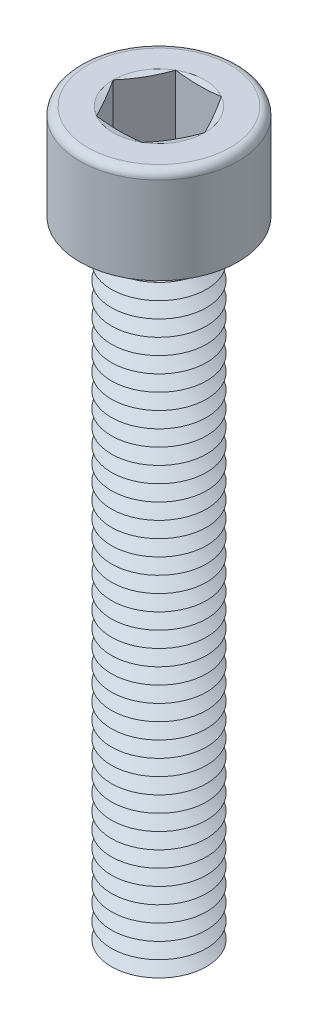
ISO-10303-21;
HEADER;
FILE_DESCRIPTION(('STEP AP214'),'2;1');
FILE_NAME('part.step','',(''),(''),'','','');
FILE_SCHEMA(('AUTOMOTIVE_DESIGN { 1 0 10303 214 1 1 1 1 }'));
ENDSEC;
DATA;
#1=APPLICATION_CONTEXT('core data for automotive mechanical design processes');
#2=APPLICATION_PROTOCOL_DEFINITION('international standard','automotive_design',2000,#1);
#3=PRODUCT_CONTEXT('',#1,'mechanical');
#4=PRODUCT('Part','Part','',(#3));
#5=PRODUCT_RELATED_PRODUCT_CATEGORY('part','',(#4));
#6=PRODUCT_DEFINITION_FORMATION('','',#4);
#7=PRODUCT_DEFINITION_CONTEXT('part definition',#1,'design');
#8=PRODUCT_DEFINITION('design','',#6,#7);
#9=PRODUCT_DEFINITION_SHAPE('','',#8);
#10=(LENGTH_UNIT() NAMED_UNIT(*) SI_UNIT(.MILLI.,.METRE.));
#11=(NAMED_UNIT(*) PLANE_ANGLE_UNIT() SI_UNIT($,.RADIAN.));
#12=(NAMED_UNIT(*) SI_UNIT($,.STERADIAN.) SOLID_ANGLE_UNIT());
#13=UNCERTAINTY_MEASURE_WITH_UNIT(LENGTH_MEASURE(1.E-05),#10,'distance_accuracy_value','');
#14=(GEOMETRIC_REPRESENTATION_CONTEXT(3) GLOBAL_UNCERTAINTY_ASSIGNED_CONTEXT((#13)) GLOBAL_UNIT_ASSIGNED_CONTEXT((#10,
#11,#12)) REPRESENTATION_CONTEXT('',''));
#15=CARTESIAN_POINT('',(0.,0.,0.));
#16=DIRECTION('',(0.,0.,1.));
#17=DIRECTION('',(1.,0.,0.));
#18=AXIS2_PLACEMENT_3D('',#15,#16,#17);
#19=CARTESIAN_POINT('',(0.,4.,0.));
#20=DIRECTION('',(0.,1.,0.));
#21=DIRECTION('',(0.,0.,1.));
#22=AXIS2_PLACEMENT_3D('',#19,#20,#21);
#23=CONICAL_SURFACE('',#22,2.13397459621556,1.0471975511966);
#24=CARTESIAN_POINT('',(0.,4.5,0.));
#25=DIRECTION('',(0.,1.,0.));
#26=DIRECTION('',(0.,0.,1.));
#27=AXIS2_PLACEMENT_3D('',#24,#25,#26);
#28=CIRCLE('',#27,3.);
#29=CARTESIAN_POINT('',(0.,4.5,3.));
#30=VERTEX_POINT('',#29);
#31=EDGE_CURVE('E629',#30,#30,#28,.T.);
#32=ORIENTED_EDGE('',*,*,#31,.F.);
#33=EDGE_LOOP('',(#32));
#34=FACE_BOUND('',#33,.T.);
#35=CARTESIAN_POINT('',(0.,4.,0.));
#36=DIRECTION('',(0.,1.,0.));
#37=DIRECTION('',(0.,0.,1.));
#38=AXIS2_PLACEMENT_3D('',#35,#36,#37);
#39=CIRCLE('',#38,2.13397459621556);
#40=CARTESIAN_POINT('',(0.,4.,2.13397459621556));
#41=VERTEX_POINT('',#40);
#42=EDGE_CURVE('E633',#41,#41,#39,.T.);
#43=ORIENTED_EDGE('',*,*,#42,.T.);
#44=EDGE_LOOP('',(#43));
#45=FACE_BOUND('',#44,.T.);
#46=ADVANCED_FACE('F41',(#34,#45),#23,.T.);
#47=CARTESIAN_POINT('',(0.,3.5,0.));
#48=DIRECTION('',(0.,-1.,0.));
#49=DIRECTION('',(0.,0.,-1.));
#50=AXIS2_PLACEMENT_3D('',#47,#48,#49);
#51=CONICAL_SURFACE('',#50,3.,1.0471975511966);
#52=ORIENTED_EDGE('',*,*,#42,.F.);
#53=EDGE_LOOP('',(#52));
#54=FACE_BOUND('',#53,.T.);
#55=CARTESIAN_POINT('',(0.,3.5,0.));
#56=DIRECTION('',(0.,1.,0.));
#57=DIRECTION('',(0.,0.,1.));
#58=AXIS2_PLACEMENT_3D('',#55,#56,#57);
#59=CIRCLE('',#58,3.);
#60=CARTESIAN_POINT('',(0.,3.5,3.));
#61=VERTEX_POINT('',#60);
#62=EDGE_CURVE('E637',#61,#61,#59,.T.);
#63=ORIENTED_EDGE('',*,*,#62,.T.);
#64=EDGE_LOOP('',(#63));
#65=FACE_BOUND('',#64,.T.);
#66=ADVANCED_FACE('F251',(#54,#65),#51,.T.);
#67=CARTESIAN_POINT('',(0.,0.,0.));
#68=DIRECTION('',(0.,1.,0.));
#69=DIRECTION('',(0.,0.,1.));
#70=AXIS2_PLACEMENT_3D('',#67,#68,#69);
#71=PLANE('',#70);
#72=CARTESIAN_POINT('',(0.,0.,0.));
#73=DIRECTION('',(0.,1.,0.));
#74=DIRECTION('',(0.,0.,1.));
#75=AXIS2_PLACEMENT_3D('',#72,#73,#74);
#76=CIRCLE('',#75,2.13397459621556);
#77=CARTESIAN_POINT('',(0.,0.,2.13397459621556));
#78=VERTEX_POINT('',#77);
#79=EDGE_CURVE('E665',#78,#78,#76,.T.);
#80=ORIENTED_EDGE('',*,*,#79,.F.);
#81=EDGE_LOOP('',(#80));
#82=FACE_BOUND('',#81,.T.);
#83=ADVANCED_FACE('F248',(#82),#71,.F.);
#84=CARTESIAN_POINT('',(0.,0.,0.));
#85=DIRECTION('',(0.,1.,0.));
#86=DIRECTION('',(0.,0.,1.));
#87=AXIS2_PLACEMENT_3D('',#84,#85,#86);
#88=CONICAL_SURFACE('',#87,2.13397459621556,1.0471975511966);
#89=CARTESIAN_POINT('',(0.,0.5,0.));
#90=DIRECTION('',(0.,1.,0.));
#91=DIRECTION('',(0.,0.,1.));
#92=AXIS2_PLACEMENT_3D('',#89,#90,#91);
#93=CIRCLE('',#92,3.);
#94=CARTESIAN_POINT('',(0.,0.5,3.));
#95=VERTEX_POINT('',#94);
#96=EDGE_CURVE('E661',#95,#95,#93,.T.);
#97=ORIENTED_EDGE('',*,*,#96,.F.);
#98=EDGE_LOOP('',(#97));
#99=FACE_BOUND('',#98,.T.);
#100=ORIENTED_EDGE('',*,*,#79,.T.);
#101=EDGE_LOOP('',(#100));
#102=FACE_BOUND('',#101,.T.);
#103=ADVANCED_FACE('F250',(#99,#102),#88,.T.);
#104=CARTESIAN_POINT('',(0.,0.5,0.));
#105=DIRECTION('',(0.,-1.,0.));
#106=DIRECTION('',(0.,0.,-1.));
#107=AXIS2_PLACEMENT_3D('',#104,#105,#106);
#108=CONICAL_SURFACE('',#107,3.,1.0471975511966);
#109=CARTESIAN_POINT('',(0.,1.,0.));
#110=DIRECTION('',(0.,1.,0.));
#111=DIRECTION('',(0.,0.,1.));
#112=AXIS2_PLACEMENT_3D('',#109,#110,#111);
#113=CIRCLE('',#112,2.13397459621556);
#114=CARTESIAN_POINT('',(0.,1.,2.13397459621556));
#115=VERTEX_POINT('',#114);
#116=EDGE_CURVE('E657',#115,#115,#113,.T.);
#117=ORIENTED_EDGE('',*,*,#116,.F.);
#118=EDGE_LOOP('',(#117));
#119=FACE_BOUND('',#118,.T.);
#120=ORIENTED_EDGE('',*,*,#96,.T.);
#121=EDGE_LOOP('',(#120));
#122=FACE_BOUND('',#121,.T.);
#123=ADVANCED_FACE('F291',(#119,#122),#108,.T.);
#124=CARTESIAN_POINT('',(0.,1.,0.));
#125=DIRECTION('',(0.,1.,0.));
#126=DIRECTION('',(0.,0.,1.));
#127=AXIS2_PLACEMENT_3D('',#124,#125,#126);
#128=CONICAL_SURFACE('',#127,2.13397459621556,1.0471975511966);
#129=CARTESIAN_POINT('',(0.,1.5,0.));
#130=DIRECTION('',(0.,1.,0.));
#131=DIRECTION('',(0.,0.,1.));
#132=AXIS2_PLACEMENT_3D('',#129,#130,#131);
#133=CIRCLE('',#132,3.);
#134=CARTESIAN_POINT('',(0.,1.5,3.));
#135=VERTEX_POINT('',#134);
#136=EDGE_CURVE('E653',#135,#135,#133,.T.);
#137=ORIENTED_EDGE('',*,*,#136,.F.);
#138=EDGE_LOOP('',(#137));
#139=FACE_BOUND('',#138,.T.);
#140=ORIENTED_EDGE('',*,*,#116,.T.);
#141=EDGE_LOOP('',(#140));
#142=FACE_BOUND('',#141,.T.);
#143=ADVANCED_FACE('F286',(#139,#142),#128,.T.);
#144=CARTESIAN_POINT('',(0.,1.5,0.));
#145=DIRECTION('',(0.,-1.,0.));
#146=DIRECTION('',(0.,0.,-1.));
#147=AXIS2_PLACEMENT_3D('',#144,#145,#146);
#148=CONICAL_SURFACE('',#147,3.,1.0471975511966);
#149=CARTESIAN_POINT('',(0.,2.,0.));
#150=DIRECTION('',(0.,1.,0.));
#151=DIRECTION('',(0.,0.,1.));
#152=AXIS2_PLACEMENT_3D('',#149,#150,#151);
#153=CIRCLE('',#152,2.13397459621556);
#154=CARTESIAN_POINT('',(0.,2.,2.13397459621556));
#155=VERTEX_POINT('',#154);
#156=EDGE_CURVE('E649',#155,#155,#153,.T.);
#157=ORIENTED_EDGE('',*,*,#156,.F.);
#158=EDGE_LOOP('',(#157));
#159=FACE_BOUND('',#158,.T.);
#160=ORIENTED_EDGE('',*,*,#136,.T.);
#161=EDGE_LOOP('',(#160));
#162=FACE_BOUND('',#161,.T.);
#163=ADVANCED_FACE('F283',(#159,#162),#148,.T.);
#164=CARTESIAN_POINT('',(0.,2.,0.));
#165=DIRECTION('',(0.,1.,0.));
#166=DIRECTION('',(0.,0.,1.));
#167=AXIS2_PLACEMENT_3D('',#164,#165,#166);
#168=CONICAL_SURFACE('',#167,2.13397459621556,1.0471975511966);
#169=CARTESIAN_POINT('',(0.,2.5,0.));
#170=DIRECTION('',(0.,1.,0.));
#171=DIRECTION('',(0.,0.,1.));
#172=AXIS2_PLACEMENT_3D('',#169,#170,#171);
#173=CIRCLE('',#172,3.);
#174=CARTESIAN_POINT('',(0.,2.5,3.));
#175=VERTEX_POINT('',#174);
#176=EDGE_CURVE('E645',#175,#175,#173,.T.);
#177=ORIENTED_EDGE('',*,*,#176,.F.);
#178=EDGE_LOOP('',(#177));
#179=FACE_BOUND('',#178,.T.);
#180=ORIENTED_EDGE('',*,*,#156,.T.);
#181=EDGE_LOOP('',(#180));
#182=FACE_BOUND('',#181,.T.);
#183=ADVANCED_FACE('F277',(#179,#182),#168,.T.);
#184=CARTESIAN_POINT('',(0.,2.5,0.));
#185=DIRECTION('',(0.,-1.,0.));
#186=DIRECTION('',(0.,0.,-1.));
#187=AXIS2_PLACEMENT_3D('',#184,#185,#186);
#188=CONICAL_SURFACE('',#187,3.,1.0471975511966);
#189=CARTESIAN_POINT('',(0.,3.,0.));
#190=DIRECTION('',(0.,1.,0.));
#191=DIRECTION('',(0.,0.,1.));
#192=AXIS2_PLACEMENT_3D('',#189,#190,#191);
#193=CIRCLE('',#192,2.13397459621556);
#194=CARTESIAN_POINT('',(0.,3.,2.13397459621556));
#195=VERTEX_POINT('',#194);
#196=EDGE_CURVE('E641',#195,#195,#193,.T.);
#197=ORIENTED_EDGE('',*,*,#196,.F.);
#198=EDGE_LOOP('',(#197));
#199=FACE_BOUND('',#198,.T.);
#200=ORIENTED_EDGE('',*,*,#176,.T.);
#201=EDGE_LOOP('',(#200));
#202=FACE_BOUND('',#201,.T.);
#203=ADVANCED_FACE('F273',(#199,#202),#188,.T.);
#204=CARTESIAN_POINT('',(0.,3.,0.));
#205=DIRECTION('',(0.,1.,0.));
#206=DIRECTION('',(0.,0.,1.));
#207=AXIS2_PLACEMENT_3D('',#204,#205,#206);
#208=CONICAL_SURFACE('',#207,2.13397459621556,1.0471975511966);
#209=ORIENTED_EDGE('',*,*,#62,.F.);
#210=EDGE_LOOP('',(#209));
#211=FACE_BOUND('',#210,.T.);
#212=ORIENTED_EDGE('',*,*,#196,.T.);
#213=EDGE_LOOP('',(#212));
#214=FACE_BOUND('',#213,.T.);
#215=ADVANCED_FACE('F276',(#211,#214),#208,.T.);
#216=CARTESIAN_POINT('',(0.,5.,0.));
#217=DIRECTION('',(0.,1.,0.));
#218=DIRECTION('',(0.,0.,1.));
#219=AXIS2_PLACEMENT_3D('',#216,#217,#218);
#220=CONICAL_SURFACE('',#219,2.13397459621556,1.0471975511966);
#221=CARTESIAN_POINT('',(0.,5.5,0.));
#222=DIRECTION('',(0.,1.,0.));
#223=DIRECTION('',(0.,0.,1.));
#224=AXIS2_PLACEMENT_3D('',#221,#222,#223);
#225=CIRCLE('',#224,3.);
#226=CARTESIAN_POINT('',(0.,5.5,3.));
#227=VERTEX_POINT('',#226);
#228=EDGE_CURVE('E621',#227,#227,#225,.T.);
#229=ORIENTED_EDGE('',*,*,#228,.F.);
#230=EDGE_LOOP('',(#229));
#231=FACE_BOUND('',#230,.T.);
#232=CARTESIAN_POINT('',(0.,5.,0.));
#233=DIRECTION('',(0.,1.,0.));
#234=DIRECTION('',(0.,0.,1.));
#235=AXIS2_PLACEMENT_3D('',#232,#233,#234);
#236=CIRCLE('',#235,2.13397459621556);
#237=CARTESIAN_POINT('',(0.,5.,2.13397459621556));
#238=VERTEX_POINT('',#237);
#239=EDGE_CURVE('E625',#238,#238,#236,.T.);
#240=ORIENTED_EDGE('',*,*,#239,.T.);
#241=EDGE_LOOP('',(#240));
#242=FACE_BOUND('',#241,.T.);
#243=ADVANCED_FACE('F281',(#231,#242),#220,.T.);
#244=CARTESIAN_POINT('',(0.,4.5,0.));
#245=DIRECTION('',(0.,-1.,0.));
#246=DIRECTION('',(0.,0.,-1.));
#247=AXIS2_PLACEMENT_3D('',#244,#245,#246);
#248=CONICAL_SURFACE('',#247,3.,1.0471975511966);
#249=ORIENTED_EDGE('',*,*,#239,.F.);
#250=EDGE_LOOP('',(#249));
#251=FACE_BOUND('',#250,.T.);
#252=ORIENTED_EDGE('',*,*,#31,.T.);
#253=EDGE_LOOP('',(#252));
#254=FACE_BOUND('',#253,.T.);
#255=ADVANCED_FACE('F905',(#251,#254),#248,.T.);
#256=CARTESIAN_POINT('',(0.,6.,0.));
#257=DIRECTION('',(0.,1.,0.));
#258=DIRECTION('',(0.,0.,1.));
#259=AXIS2_PLACEMENT_3D('',#256,#257,#258);
#260=CONICAL_SURFACE('',#259,2.13397459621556,1.0471975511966);
#261=CARTESIAN_POINT('',(0.,6.5,0.));
#262=DIRECTION('',(0.,1.,0.));
#263=DIRECTION('',(0.,0.,1.));
#264=AXIS2_PLACEMENT_3D('',#261,#262,#263);
#265=CIRCLE('',#264,3.);
#266=CARTESIAN_POINT('',(0.,6.5,3.));
#267=VERTEX_POINT('',#266);
#268=EDGE_CURVE('E614',#267,#267,#265,.T.);
#269=ORIENTED_EDGE('',*,*,#268,.F.);
#270=EDGE_LOOP('',(#269));
#271=FACE_BOUND('',#270,.T.);
#272=CARTESIAN_POINT('',(0.,6.,0.));
#273=DIRECTION('',(0.,1.,0.));
#274=DIRECTION('',(0.,0.,1.));
#275=AXIS2_PLACEMENT_3D('',#272,#273,#274);
#276=CIRCLE('',#275,2.13397459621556);
#277=CARTESIAN_POINT('',(0.,6.,2.13397459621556));
#278=VERTEX_POINT('',#277);
#279=EDGE_CURVE('E618',#278,#278,#276,.T.);
#280=ORIENTED_EDGE('',*,*,#279,.T.);
#281=EDGE_LOOP('',(#280));
#282=FACE_BOUND('',#281,.T.);
#283=ADVANCED_FACE('F914',(#271,#282),#260,.T.);
#284=CARTESIAN_POINT('',(0.,5.5,0.));
#285=DIRECTION('',(0.,-1.,0.));
#286=DIRECTION('',(0.,0.,-1.));
#287=AXIS2_PLACEMENT_3D('',#284,#285,#286);
#288=CONICAL_SURFACE('',#287,3.,1.0471975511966);
#289=ORIENTED_EDGE('',*,*,#279,.F.);
#290=EDGE_LOOP('',(#289));
#291=FACE_BOUND('',#290,.T.);
#292=ORIENTED_EDGE('',*,*,#228,.T.);
#293=EDGE_LOOP('',(#292));
#294=FACE_BOUND('',#293,.T.);
#295=ADVANCED_FACE('F924',(#291,#294),#288,.T.);
#296=CARTESIAN_POINT('',(0.,7.,0.));
#297=DIRECTION('',(0.,1.,0.));
#298=DIRECTION('',(0.,0.,1.));
#299=AXIS2_PLACEMENT_3D('',#296,#297,#298);
#300=CONICAL_SURFACE('',#299,2.13397459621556,1.0471975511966);
#301=CARTESIAN_POINT('',(0.,7.5,0.));
#302=DIRECTION('',(0.,1.,0.));
#303=DIRECTION('',(0.,0.,1.));
#304=AXIS2_PLACEMENT_3D('',#301,#302,#303);
#305=CIRCLE('',#304,3.);
#306=CARTESIAN_POINT('',(0.,7.5,3.));
#307=VERTEX_POINT('',#306);
#308=EDGE_CURVE('E606',#307,#307,#305,.T.);
#309=ORIENTED_EDGE('',*,*,#308,.F.);
#310=EDGE_LOOP('',(#309));
#311=FACE_BOUND('',#310,.T.);
#312=CARTESIAN_POINT('',(0.,7.,0.));
#313=DIRECTION('',(0.,1.,0.));
#314=DIRECTION('',(0.,0.,1.));
#315=AXIS2_PLACEMENT_3D('',#312,#313,#314);
#316=CIRCLE('',#315,2.13397459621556);
#317=CARTESIAN_POINT('',(0.,7.,2.13397459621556));
#318=VERTEX_POINT('',#317);
#319=EDGE_CURVE('E610',#318,#318,#316,.T.);
#320=ORIENTED_EDGE('',*,*,#319,.T.);
#321=EDGE_LOOP('',(#320));
#322=FACE_BOUND('',#321,.T.);
#323=ADVANCED_FACE('F934',(#311,#322),#300,.T.);
#324=CARTESIAN_POINT('',(0.,6.5,0.));
#325=DIRECTION('',(0.,-1.,0.));
#326=DIRECTION('',(0.,0.,-1.));
#327=AXIS2_PLACEMENT_3D('',#324,#325,#326);
#328=CONICAL_SURFACE('',#327,3.,1.0471975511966);
#329=ORIENTED_EDGE('',*,*,#319,.F.);
#330=EDGE_LOOP('',(#329));
#331=FACE_BOUND('',#330,.T.);
#332=ORIENTED_EDGE('',*,*,#268,.T.);
#333=EDGE_LOOP('',(#332));
#334=FACE_BOUND('',#333,.T.);
#335=ADVANCED_FACE('F944',(#331,#334),#328,.T.);
#336=CARTESIAN_POINT('',(0.,8.,0.));
#337=DIRECTION('',(0.,1.,0.));
#338=DIRECTION('',(0.,0.,1.));
#339=AXIS2_PLACEMENT_3D('',#336,#337,#338);
#340=CONICAL_SURFACE('',#339,2.13397459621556,1.0471975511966);
#341=CARTESIAN_POINT('',(0.,8.5,0.));
#342=DIRECTION('',(0.,1.,0.));
#343=DIRECTION('',(0.,0.,1.));
#344=AXIS2_PLACEMENT_3D('',#341,#342,#343);
#345=CIRCLE('',#344,3.);
#346=CARTESIAN_POINT('',(0.,8.5,3.));
#347=VERTEX_POINT('',#346);
#348=EDGE_CURVE('E598',#347,#347,#345,.T.);
#349=ORIENTED_EDGE('',*,*,#348,.F.);
#350=EDGE_LOOP('',(#349));
#351=FACE_BOUND('',#350,.T.);
#352=CARTESIAN_POINT('',(0.,8.,0.));
#353=DIRECTION('',(0.,1.,0.));
#354=DIRECTION('',(0.,0.,1.));
#355=AXIS2_PLACEMENT_3D('',#352,#353,#354);
#356=CIRCLE('',#355,2.13397459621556);
#357=CARTESIAN_POINT('',(0.,8.,2.13397459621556));
#358=VERTEX_POINT('',#357);
#359=EDGE_CURVE('E602',#358,#358,#356,.T.);
#360=ORIENTED_EDGE('',*,*,#359,.T.);
#361=EDGE_LOOP('',(#360));
#362=FACE_BOUND('',#361,.T.);
#363=ADVANCED_FACE('F954',(#351,#362),#340,.T.);
#364=CARTESIAN_POINT('',(0.,7.5,0.));
#365=DIRECTION('',(0.,-1.,0.));
#366=DIRECTION('',(0.,0.,-1.));
#367=AXIS2_PLACEMENT_3D('',#364,#365,#366);
#368=CONICAL_SURFACE('',#367,3.,1.0471975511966);
#369=ORIENTED_EDGE('',*,*,#359,.F.);
#370=EDGE_LOOP('',(#369));
#371=FACE_BOUND('',#370,.T.);
#372=ORIENTED_EDGE('',*,*,#308,.T.);
#373=EDGE_LOOP('',(#372));
#374=FACE_BOUND('',#373,.T.);
#375=ADVANCED_FACE('F964',(#371,#374),#368,.T.);
#376=CARTESIAN_POINT('',(0.,9.,0.));
#377=DIRECTION('',(0.,1.,0.));
#378=DIRECTION('',(0.,0.,1.));
#379=AXIS2_PLACEMENT_3D('',#376,#377,#378);
#380=CONICAL_SURFACE('',#379,2.13397459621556,1.0471975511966);
#381=CARTESIAN_POINT('',(0.,9.5,0.));
#382=DIRECTION('',(0.,1.,0.));
#383=DIRECTION('',(0.,0.,1.));
#384=AXIS2_PLACEMENT_3D('',#381,#382,#383);
#385=CIRCLE('',#384,3.);
#386=CARTESIAN_POINT('',(0.,9.5,3.));
#387=VERTEX_POINT('',#386);
#388=EDGE_CURVE('E590',#387,#387,#385,.T.);
#389=ORIENTED_EDGE('',*,*,#388,.F.);
#390=EDGE_LOOP('',(#389));
#391=FACE_BOUND('',#390,.T.);
#392=CARTESIAN_POINT('',(0.,9.,0.));
#393=DIRECTION('',(0.,1.,0.));
#394=DIRECTION('',(0.,0.,1.));
#395=AXIS2_PLACEMENT_3D('',#392,#393,#394);
#396=CIRCLE('',#395,2.13397459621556);
#397=CARTESIAN_POINT('',(0.,9.,2.13397459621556));
#398=VERTEX_POINT('',#397);
#399=EDGE_CURVE('E594',#398,#398,#396,.T.);
#400=ORIENTED_EDGE('',*,*,#399,.T.);
#401=EDGE_LOOP('',(#400));
#402=FACE_BOUND('',#401,.T.);
#403=ADVANCED_FACE('F974',(#391,#402),#380,.T.);
#404=CARTESIAN_POINT('',(0.,8.5,0.));
#405=DIRECTION('',(0.,-1.,0.));
#406=DIRECTION('',(0.,0.,-1.));
#407=AXIS2_PLACEMENT_3D('',#404,#405,#406);
#408=CONICAL_SURFACE('',#407,3.,1.0471975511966);
#409=ORIENTED_EDGE('',*,*,#399,.F.);
#410=EDGE_LOOP('',(#409));
#411=FACE_BOUND('',#410,.T.);
#412=ORIENTED_EDGE('',*,*,#348,.T.);
#413=EDGE_LOOP('',(#412));
#414=FACE_BOUND('',#413,.T.);
#415=ADVANCED_FACE('F984',(#411,#414),#408,.T.);
#416=CARTESIAN_POINT('',(0.,10.,0.));
#417=DIRECTION('',(0.,1.,0.));
#418=DIRECTION('',(0.,0.,1.));
#419=AXIS2_PLACEMENT_3D('',#416,#417,#418);
#420=CONICAL_SURFACE('',#419,2.13397459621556,1.0471975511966);
#421=CARTESIAN_POINT('',(0.,10.5,0.));
#422=DIRECTION('',(0.,1.,0.));
#423=DIRECTION('',(0.,0.,1.));
#424=AXIS2_PLACEMENT_3D('',#421,#422,#423);
#425=CIRCLE('',#424,3.);
#426=CARTESIAN_POINT('',(0.,10.5,3.));
#427=VERTEX_POINT('',#426);
#428=EDGE_CURVE('E582',#427,#427,#425,.T.);
#429=ORIENTED_EDGE('',*,*,#428,.F.);
#430=EDGE_LOOP('',(#429));
#431=FACE_BOUND('',#430,.T.);
#432=CARTESIAN_POINT('',(0.,10.,0.));
#433=DIRECTION('',(0.,1.,0.));
#434=DIRECTION('',(0.,0.,1.));
#435=AXIS2_PLACEMENT_3D('',#432,#433,#434);
#436=CIRCLE('',#435,2.13397459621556);
#437=CARTESIAN_POINT('',(0.,10.,2.13397459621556));
#438=VERTEX_POINT('',#437);
#439=EDGE_CURVE('E586',#438,#438,#436,.T.);
#440=ORIENTED_EDGE('',*,*,#439,.T.);
#441=EDGE_LOOP('',(#440));
#442=FACE_BOUND('',#441,.T.);
#443=ADVANCED_FACE('F994',(#431,#442),#420,.T.);
#444=CARTESIAN_POINT('',(0.,9.5,0.));
#445=DIRECTION('',(0.,-1.,0.));
#446=DIRECTION('',(0.,0.,-1.));
#447=AXIS2_PLACEMENT_3D('',#444,#445,#446);
#448=CONICAL_SURFACE('',#447,3.,1.0471975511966);
#449=ORIENTED_EDGE('',*,*,#439,.F.);
#450=EDGE_LOOP('',(#449));
#451=FACE_BOUND('',#450,.T.);
#452=ORIENTED_EDGE('',*,*,#388,.T.);
#453=EDGE_LOOP('',(#452));
#454=FACE_BOUND('',#453,.T.);
#455=ADVANCED_FACE('F1004',(#451,#454),#448,.T.);
#456=CARTESIAN_POINT('',(0.,11.,0.));
#457=DIRECTION('',(0.,1.,0.));
#458=DIRECTION('',(0.,0.,1.));
#459=AXIS2_PLACEMENT_3D('',#456,#457,#458);
#460=CONICAL_SURFACE('',#459,2.13397459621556,1.0471975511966);
#461=CARTESIAN_POINT('',(0.,11.5,0.));
#462=DIRECTION('',(0.,1.,0.));
#463=DIRECTION('',(0.,0.,1.));
#464=AXIS2_PLACEMENT_3D('',#461,#462,#463);
#465=CIRCLE('',#464,3.);
#466=CARTESIAN_POINT('',(0.,11.5,3.));
#467=VERTEX_POINT('',#466);
#468=EDGE_CURVE('E574',#467,#467,#465,.T.);
#469=ORIENTED_EDGE('',*,*,#468,.F.);
#470=EDGE_LOOP('',(#469));
#471=FACE_BOUND('',#470,.T.);
#472=CARTESIAN_POINT('',(0.,11.,0.));
#473=DIRECTION('',(0.,1.,0.));
#474=DIRECTION('',(0.,0.,1.));
#475=AXIS2_PLACEMENT_3D('',#472,#473,#474);
#476=CIRCLE('',#475,2.13397459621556);
#477=CARTESIAN_POINT('',(0.,11.,2.13397459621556));
#478=VERTEX_POINT('',#477);
#479=EDGE_CURVE('E578',#478,#478,#476,.T.);
#480=ORIENTED_EDGE('',*,*,#479,.T.);
#481=EDGE_LOOP('',(#480));
#482=FACE_BOUND('',#481,.T.);
#483=ADVANCED_FACE('F1014',(#471,#482),#460,.T.);
#484=CARTESIAN_POINT('',(0.,10.5,0.));
#485=DIRECTION('',(0.,-1.,0.));
#486=DIRECTION('',(0.,0.,-1.));
#487=AXIS2_PLACEMENT_3D('',#484,#485,#486);
#488=CONICAL_SURFACE('',#487,3.,1.0471975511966);
#489=ORIENTED_EDGE('',*,*,#479,.F.);
#490=EDGE_LOOP('',(#489));
#491=FACE_BOUND('',#490,.T.);
#492=ORIENTED_EDGE('',*,*,#428,.T.);
#493=EDGE_LOOP('',(#492));
#494=FACE_BOUND('',#493,.T.);
#495=ADVANCED_FACE('F1024',(#491,#494),#488,.T.);
#496=CARTESIAN_POINT('',(0.,12.,0.));
#497=DIRECTION('',(0.,1.,0.));
#498=DIRECTION('',(0.,0.,1.));
#499=AXIS2_PLACEMENT_3D('',#496,#497,#498);
#500=CONICAL_SURFACE('',#499,2.13397459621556,1.0471975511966);
#501=CARTESIAN_POINT('',(0.,12.5,0.));
#502=DIRECTION('',(0.,1.,0.));
#503=DIRECTION('',(0.,0.,1.));
#504=AXIS2_PLACEMENT_3D('',#501,#502,#503);
#505=CIRCLE('',#504,3.);
#506=CARTESIAN_POINT('',(0.,12.5,3.));
#507=VERTEX_POINT('',#506);
#508=EDGE_CURVE('E566',#507,#507,#505,.T.);
#509=ORIENTED_EDGE('',*,*,#508,.F.);
#510=EDGE_LOOP('',(#509));
#511=FACE_BOUND('',#510,.T.);
#512=CARTESIAN_POINT('',(0.,12.,0.));
#513=DIRECTION('',(0.,1.,0.));
#514=DIRECTION('',(0.,0.,1.));
#515=AXIS2_PLACEMENT_3D('',#512,#513,#514);
#516=CIRCLE('',#515,2.13397459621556);
#517=CARTESIAN_POINT('',(0.,12.,2.13397459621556));
#518=VERTEX_POINT('',#517);
#519=EDGE_CURVE('E570',#518,#518,#516,.T.);
#520=ORIENTED_EDGE('',*,*,#519,.T.);
#521=EDGE_LOOP('',(#520));
#522=FACE_BOUND('',#521,.T.);
#523=ADVANCED_FACE('F1034',(#511,#522),#500,.T.);
#524=CARTESIAN_POINT('',(0.,11.5,0.));
#525=DIRECTION('',(0.,-1.,0.));
#526=DIRECTION('',(0.,0.,-1.));
#527=AXIS2_PLACEMENT_3D('',#524,#525,#526);
#528=CONICAL_SURFACE('',#527,3.,1.0471975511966);
#529=ORIENTED_EDGE('',*,*,#519,.F.);
#530=EDGE_LOOP('',(#529));
#531=FACE_BOUND('',#530,.T.);
#532=ORIENTED_EDGE('',*,*,#468,.T.);
#533=EDGE_LOOP('',(#532));
#534=FACE_BOUND('',#533,.T.);
#535=ADVANCED_FACE('F1044',(#531,#534),#528,.T.);
#536=CARTESIAN_POINT('',(0.,13.,0.));
#537=DIRECTION('',(0.,1.,0.));
#538=DIRECTION('',(0.,0.,1.));
#539=AXIS2_PLACEMENT_3D('',#536,#537,#538);
#540=CONICAL_SURFACE('',#539,2.13397459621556,1.0471975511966);
#541=CARTESIAN_POINT('',(0.,13.5,0.));
#542=DIRECTION('',(0.,1.,0.));
#543=DIRECTION('',(0.,0.,1.));
#544=AXIS2_PLACEMENT_3D('',#541,#542,#543);
#545=CIRCLE('',#544,3.);
#546=CARTESIAN_POINT('',(0.,13.5,3.));
#547=VERTEX_POINT('',#546);
#548=EDGE_CURVE('E558',#547,#547,#545,.T.);
#549=ORIENTED_EDGE('',*,*,#548,.F.);
#550=EDGE_LOOP('',(#549));
#551=FACE_BOUND('',#550,.T.);
#552=CARTESIAN_POINT('',(0.,13.,0.));
#553=DIRECTION('',(0.,1.,0.));
#554=DIRECTION('',(0.,0.,1.));
#555=AXIS2_PLACEMENT_3D('',#552,#553,#554);
#556=CIRCLE('',#555,2.13397459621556);
#557=CARTESIAN_POINT('',(0.,13.,2.13397459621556));
#558=VERTEX_POINT('',#557);
#559=EDGE_CURVE('E562',#558,#558,#556,.T.);
#560=ORIENTED_EDGE('',*,*,#559,.T.);
#561=EDGE_LOOP('',(#560));
#562=FACE_BOUND('',#561,.T.);
#563=ADVANCED_FACE('F1054',(#551,#562),#540,.T.);
#564=CARTESIAN_POINT('',(0.,12.5,0.));
#565=DIRECTION('',(0.,-1.,0.));
#566=DIRECTION('',(0.,0.,-1.));
#567=AXIS2_PLACEMENT_3D('',#564,#565,#566);
#568=CONICAL_SURFACE('',#567,3.,1.0471975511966);
#569=ORIENTED_EDGE('',*,*,#559,.F.);
#570=EDGE_LOOP('',(#569));
#571=FACE_BOUND('',#570,.T.);
#572=ORIENTED_EDGE('',*,*,#508,.T.);
#573=EDGE_LOOP('',(#572));
#574=FACE_BOUND('',#573,.T.);
#575=ADVANCED_FACE('F1064',(#571,#574),#568,.T.);
#576=CARTESIAN_POINT('',(0.,14.,0.));
#577=DIRECTION('',(0.,1.,0.));
#578=DIRECTION('',(0.,0.,1.));
#579=AXIS2_PLACEMENT_3D('',#576,#577,#578);
#580=CONICAL_SURFACE('',#579,2.13397459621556,1.0471975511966);
#581=CARTESIAN_POINT('',(0.,14.5,0.));
#582=DIRECTION('',(0.,1.,0.));
#583=DIRECTION('',(0.,0.,1.));
#584=AXIS2_PLACEMENT_3D('',#581,#582,#583);
#585=CIRCLE('',#584,3.);
#586=CARTESIAN_POINT('',(0.,14.5,3.));
#587=VERTEX_POINT('',#586);
#588=EDGE_CURVE('E550',#587,#587,#585,.T.);
#589=ORIENTED_EDGE('',*,*,#588,.F.);
#590=EDGE_LOOP('',(#589));
#591=FACE_BOUND('',#590,.T.);
#592=CARTESIAN_POINT('',(0.,14.,0.));
#593=DIRECTION('',(0.,1.,0.));
#594=DIRECTION('',(0.,0.,1.));
#595=AXIS2_PLACEMENT_3D('',#592,#593,#594);
#596=CIRCLE('',#595,2.13397459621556);
#597=CARTESIAN_POINT('',(0.,14.,2.13397459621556));
#598=VERTEX_POINT('',#597);
#599=EDGE_CURVE('E554',#598,#598,#596,.T.);
#600=ORIENTED_EDGE('',*,*,#599,.T.);
#601=EDGE_LOOP('',(#600));
#602=FACE_BOUND('',#601,.T.);
#603=ADVANCED_FACE('F1074',(#591,#602),#580,.T.);
#604=CARTESIAN_POINT('',(0.,13.5,0.));
#605=DIRECTION('',(0.,-1.,0.));
#606=DIRECTION('',(0.,0.,-1.));
#607=AXIS2_PLACEMENT_3D('',#604,#605,#606);
#608=CONICAL_SURFACE('',#607,3.,1.0471975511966);
#609=ORIENTED_EDGE('',*,*,#599,.F.);
#610=EDGE_LOOP('',(#609));
#611=FACE_BOUND('',#610,.T.);
#612=ORIENTED_EDGE('',*,*,#548,.T.);
#613=EDGE_LOOP('',(#612));
#614=FACE_BOUND('',#613,.T.);
#615=ADVANCED_FACE('F1084',(#611,#614),#608,.T.);
#616=CARTESIAN_POINT('',(0.,15.,0.));
#617=DIRECTION('',(0.,1.,0.));
#618=DIRECTION('',(0.,0.,1.));
#619=AXIS2_PLACEMENT_3D('',#616,#617,#618);
#620=CONICAL_SURFACE('',#619,2.13397459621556,1.0471975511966);
#621=CARTESIAN_POINT('',(0.,15.5,0.));
#622=DIRECTION('',(0.,1.,0.));
#623=DIRECTION('',(0.,0.,1.));
#624=AXIS2_PLACEMENT_3D('',#621,#622,#623);
#625=CIRCLE('',#624,3.);
#626=CARTESIAN_POINT('',(0.,15.5,3.));
#627=VERTEX_POINT('',#626);
#628=EDGE_CURVE('E542',#627,#627,#625,.T.);
#629=ORIENTED_EDGE('',*,*,#628,.F.);
#630=EDGE_LOOP('',(#629));
#631=FACE_BOUND('',#630,.T.);
#632=CARTESIAN_POINT('',(0.,15.,0.));
#633=DIRECTION('',(0.,1.,0.));
#634=DIRECTION('',(0.,0.,1.));
#635=AXIS2_PLACEMENT_3D('',#632,#633,#634);
#636=CIRCLE('',#635,2.13397459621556);
#637=CARTESIAN_POINT('',(0.,15.,2.13397459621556));
#638=VERTEX_POINT('',#637);
#639=EDGE_CURVE('E546',#638,#638,#636,.T.);
#640=ORIENTED_EDGE('',*,*,#639,.T.);
#641=EDGE_LOOP('',(#640));
#642=FACE_BOUND('',#641,.T.);
#643=ADVANCED_FACE('F1094',(#631,#642),#620,.T.);
#644=CARTESIAN_POINT('',(0.,14.5,0.));
#645=DIRECTION('',(0.,-1.,0.));
#646=DIRECTION('',(0.,0.,-1.));
#647=AXIS2_PLACEMENT_3D('',#644,#645,#646);
#648=CONICAL_SURFACE('',#647,3.,1.0471975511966);
#649=ORIENTED_EDGE('',*,*,#639,.F.);
#650=EDGE_LOOP('',(#649));
#651=FACE_BOUND('',#650,.T.);
#652=ORIENTED_EDGE('',*,*,#588,.T.);
#653=EDGE_LOOP('',(#652));
#654=FACE_BOUND('',#653,.T.);
#655=ADVANCED_FACE('F1104',(#651,#654),#648,.T.);
#656=CARTESIAN_POINT('',(0.,16.,0.));
#657=DIRECTION('',(0.,1.,0.));
#658=DIRECTION('',(0.,0.,1.));
#659=AXIS2_PLACEMENT_3D('',#656,#657,#658);
#660=CONICAL_SURFACE('',#659,2.13397459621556,1.0471975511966);
#661=CARTESIAN_POINT('',(0.,16.5,0.));
#662=DIRECTION('',(0.,1.,0.));
#663=DIRECTION('',(0.,0.,1.));
#664=AXIS2_PLACEMENT_3D('',#661,#662,#663);
#665=CIRCLE('',#664,3.);
#666=CARTESIAN_POINT('',(0.,16.5,3.));
#667=VERTEX_POINT('',#666);
#668=EDGE_CURVE('E534',#667,#667,#665,.T.);
#669=ORIENTED_EDGE('',*,*,#668,.F.);
#670=EDGE_LOOP('',(#669));
#671=FACE_BOUND('',#670,.T.);
#672=CARTESIAN_POINT('',(0.,16.,0.));
#673=DIRECTION('',(0.,1.,0.));
#674=DIRECTION('',(0.,0.,1.));
#675=AXIS2_PLACEMENT_3D('',#672,#673,#674);
#676=CIRCLE('',#675,2.13397459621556);
#677=CARTESIAN_POINT('',(0.,16.,2.13397459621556));
#678=VERTEX_POINT('',#677);
#679=EDGE_CURVE('E538',#678,#678,#676,.T.);
#680=ORIENTED_EDGE('',*,*,#679,.T.);
#681=EDGE_LOOP('',(#680));
#682=FACE_BOUND('',#681,.T.);
#683=ADVANCED_FACE('F1114',(#671,#682),#660,.T.);
#684=CARTESIAN_POINT('',(0.,15.5,0.));
#685=DIRECTION('',(0.,-1.,0.));
#686=DIRECTION('',(0.,0.,-1.));
#687=AXIS2_PLACEMENT_3D('',#684,#685,#686);
#688=CONICAL_SURFACE('',#687,3.,1.0471975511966);
#689=ORIENTED_EDGE('',*,*,#679,.F.);
#690=EDGE_LOOP('',(#689));
#691=FACE_BOUND('',#690,.T.);
#692=ORIENTED_EDGE('',*,*,#628,.T.);
#693=EDGE_LOOP('',(#692));
#694=FACE_BOUND('',#693,.T.);
#695=ADVANCED_FACE('F1124',(#691,#694),#688,.T.);
#696=CARTESIAN_POINT('',(0.,17.,0.));
#697=DIRECTION('',(0.,1.,0.));
#698=DIRECTION('',(0.,0.,1.));
#699=AXIS2_PLACEMENT_3D('',#696,#697,#698);
#700=CONICAL_SURFACE('',#699,2.13397459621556,1.0471975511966);
#701=CARTESIAN_POINT('',(0.,17.5,0.));
#702=DIRECTION('',(0.,1.,0.));
#703=DIRECTION('',(0.,0.,1.));
#704=AXIS2_PLACEMENT_3D('',#701,#702,#703);
#705=CIRCLE('',#704,3.);
#706=CARTESIAN_POINT('',(0.,17.5,3.));
#707=VERTEX_POINT('',#706);
#708=EDGE_CURVE('E526',#707,#707,#705,.T.);
#709=ORIENTED_EDGE('',*,*,#708,.F.);
#710=EDGE_LOOP('',(#709));
#711=FACE_BOUND('',#710,.T.);
#712=CARTESIAN_POINT('',(0.,17.,0.));
#713=DIRECTION('',(0.,1.,0.));
#714=DIRECTION('',(0.,0.,1.));
#715=AXIS2_PLACEMENT_3D('',#712,#713,#714);
#716=CIRCLE('',#715,2.13397459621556);
#717=CARTESIAN_POINT('',(0.,17.,2.13397459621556));
#718=VERTEX_POINT('',#717);
#719=EDGE_CURVE('E530',#718,#718,#716,.T.);
#720=ORIENTED_EDGE('',*,*,#719,.T.);
#721=EDGE_LOOP('',(#720));
#722=FACE_BOUND('',#721,.T.);
#723=ADVANCED_FACE('F1134',(#711,#722),#700,.T.);
#724=CARTESIAN_POINT('',(0.,16.5,0.));
#725=DIRECTION('',(0.,-1.,0.));
#726=DIRECTION('',(0.,0.,-1.));
#727=AXIS2_PLACEMENT_3D('',#724,#725,#726);
#728=CONICAL_SURFACE('',#727,3.,1.0471975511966);
#729=ORIENTED_EDGE('',*,*,#719,.F.);
#730=EDGE_LOOP('',(#729));
#731=FACE_BOUND('',#730,.T.);
#732=ORIENTED_EDGE('',*,*,#668,.T.);
#733=EDGE_LOOP('',(#732));
#734=FACE_BOUND('',#733,.T.);
#735=ADVANCED_FACE('F1144',(#731,#734),#728,.T.);
#736=CARTESIAN_POINT('',(0.,18.,0.));
#737=DIRECTION('',(0.,1.,0.));
#738=DIRECTION('',(0.,0.,1.));
#739=AXIS2_PLACEMENT_3D('',#736,#737,#738);
#740=CONICAL_SURFACE('',#739,2.13397459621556,1.0471975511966);
#741=CARTESIAN_POINT('',(0.,18.5,0.));
#742=DIRECTION('',(0.,1.,0.));
#743=DIRECTION('',(0.,0.,1.));
#744=AXIS2_PLACEMENT_3D('',#741,#742,#743);
#745=CIRCLE('',#744,3.);
#746=CARTESIAN_POINT('',(0.,18.5,3.));
#747=VERTEX_POINT('',#746);
#748=EDGE_CURVE('E518',#747,#747,#745,.T.);
#749=ORIENTED_EDGE('',*,*,#748,.F.);
#750=EDGE_LOOP('',(#749));
#751=FACE_BOUND('',#750,.T.);
#752=CARTESIAN_POINT('',(0.,18.,0.));
#753=DIRECTION('',(0.,1.,0.));
#754=DIRECTION('',(0.,0.,1.));
#755=AXIS2_PLACEMENT_3D('',#752,#753,#754);
#756=CIRCLE('',#755,2.13397459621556);
#757=CARTESIAN_POINT('',(0.,18.,2.13397459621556));
#758=VERTEX_POINT('',#757);
#759=EDGE_CURVE('E522',#758,#758,#756,.T.);
#760=ORIENTED_EDGE('',*,*,#759,.T.);
#761=EDGE_LOOP('',(#760));
#762=FACE_BOUND('',#761,.T.);
#763=ADVANCED_FACE('F1154',(#751,#762),#740,.T.);
#764=CARTESIAN_POINT('',(0.,17.5,0.));
#765=DIRECTION('',(0.,-1.,0.));
#766=DIRECTION('',(0.,0.,-1.));
#767=AXIS2_PLACEMENT_3D('',#764,#765,#766);
#768=CONICAL_SURFACE('',#767,3.,1.0471975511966);
#769=ORIENTED_EDGE('',*,*,#759,.F.);
#770=EDGE_LOOP('',(#769));
#771=FACE_BOUND('',#770,.T.);
#772=ORIENTED_EDGE('',*,*,#708,.T.);
#773=EDGE_LOOP('',(#772));
#774=FACE_BOUND('',#773,.T.);
#775=ADVANCED_FACE('F1164',(#771,#774),#768,.T.);
#776=CARTESIAN_POINT('',(0.,19.,0.));
#777=DIRECTION('',(0.,1.,0.));
#778=DIRECTION('',(0.,0.,1.));
#779=AXIS2_PLACEMENT_3D('',#776,#777,#778);
#780=CONICAL_SURFACE('',#779,2.13397459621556,1.0471975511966);
#781=CARTESIAN_POINT('',(0.,19.5,0.));
#782=DIRECTION('',(0.,1.,0.));
#783=DIRECTION('',(0.,0.,1.));
#784=AXIS2_PLACEMENT_3D('',#781,#782,#783);
#785=CIRCLE('',#784,3.);
#786=CARTESIAN_POINT('',(0.,19.5,3.));
#787=VERTEX_POINT('',#786);
#788=EDGE_CURVE('E510',#787,#787,#785,.T.);
#789=ORIENTED_EDGE('',*,*,#788,.F.);
#790=EDGE_LOOP('',(#789));
#791=FACE_BOUND('',#790,.T.);
#792=CARTESIAN_POINT('',(0.,19.,0.));
#793=DIRECTION('',(0.,1.,0.));
#794=DIRECTION('',(0.,0.,1.));
#795=AXIS2_PLACEMENT_3D('',#792,#793,#794);
#796=CIRCLE('',#795,2.13397459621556);
#797=CARTESIAN_POINT('',(0.,19.,2.13397459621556));
#798=VERTEX_POINT('',#797);
#799=EDGE_CURVE('E514',#798,#798,#796,.T.);
#800=ORIENTED_EDGE('',*,*,#799,.T.);
#801=EDGE_LOOP('',(#800));
#802=FACE_BOUND('',#801,.T.);
#803=ADVANCED_FACE('F1174',(#791,#802),#780,.T.);
#804=CARTESIAN_POINT('',(0.,18.5,0.));
#805=DIRECTION('',(0.,-1.,0.));
#806=DIRECTION('',(0.,0.,-1.));
#807=AXIS2_PLACEMENT_3D('',#804,#805,#806);
#808=CONICAL_SURFACE('',#807,3.,1.0471975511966);
#809=ORIENTED_EDGE('',*,*,#799,.F.);
#810=EDGE_LOOP('',(#809));
#811=FACE_BOUND('',#810,.T.);
#812=ORIENTED_EDGE('',*,*,#748,.T.);
#813=EDGE_LOOP('',(#812));
#814=FACE_BOUND('',#813,.T.);
#815=ADVANCED_FACE('F1184',(#811,#814),#808,.T.);
#816=CARTESIAN_POINT('',(0.,20.,0.));
#817=DIRECTION('',(0.,1.,0.));
#818=DIRECTION('',(0.,0.,1.));
#819=AXIS2_PLACEMENT_3D('',#816,#817,#818);
#820=CONICAL_SURFACE('',#819,2.13397459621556,1.0471975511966);
#821=CARTESIAN_POINT('',(0.,20.5,0.));
#822=DIRECTION('',(0.,1.,0.));
#823=DIRECTION('',(0.,0.,1.));
#824=AXIS2_PLACEMENT_3D('',#821,#822,#823);
#825=CIRCLE('',#824,3.);
#826=CARTESIAN_POINT('',(0.,20.5,3.));
#827=VERTEX_POINT('',#826);
#828=EDGE_CURVE('E502',#827,#827,#825,.T.);
#829=ORIENTED_EDGE('',*,*,#828,.F.);
#830=EDGE_LOOP('',(#829));
#831=FACE_BOUND('',#830,.T.);
#832=CARTESIAN_POINT('',(0.,20.,0.));
#833=DIRECTION('',(0.,1.,0.));
#834=DIRECTION('',(0.,0.,1.));
#835=AXIS2_PLACEMENT_3D('',#832,#833,#834);
#836=CIRCLE('',#835,2.13397459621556);
#837=CARTESIAN_POINT('',(0.,20.,2.13397459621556));
#838=VERTEX_POINT('',#837);
#839=EDGE_CURVE('E506',#838,#838,#836,.T.);
#840=ORIENTED_EDGE('',*,*,#839,.T.);
#841=EDGE_LOOP('',(#840));
#842=FACE_BOUND('',#841,.T.);
#843=ADVANCED_FACE('F1194',(#831,#842),#820,.T.);
#844=CARTESIAN_POINT('',(0.,19.5,0.));
#845=DIRECTION('',(0.,-1.,0.));
#846=DIRECTION('',(0.,0.,-1.));
#847=AXIS2_PLACEMENT_3D('',#844,#845,#846);
#848=CONICAL_SURFACE('',#847,3.,1.0471975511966);
#849=ORIENTED_EDGE('',*,*,#839,.F.);
#850=EDGE_LOOP('',(#849));
#851=FACE_BOUND('',#850,.T.);
#852=ORIENTED_EDGE('',*,*,#788,.T.);
#853=EDGE_LOOP('',(#852));
#854=FACE_BOUND('',#853,.T.);
#855=ADVANCED_FACE('F1204',(#851,#854),#848,.T.);
#856=CARTESIAN_POINT('',(0.,21.,0.));
#857=DIRECTION('',(0.,1.,0.));
#858=DIRECTION('',(0.,0.,1.));
#859=AXIS2_PLACEMENT_3D('',#856,#857,#858);
#860=CONICAL_SURFACE('',#859,2.13397459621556,1.0471975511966);
#861=CARTESIAN_POINT('',(0.,21.5,0.));
#862=DIRECTION('',(0.,1.,0.));
#863=DIRECTION('',(0.,0.,1.));
#864=AXIS2_PLACEMENT_3D('',#861,#862,#863);
#865=CIRCLE('',#864,3.);
#866=CARTESIAN_POINT('',(0.,21.5,3.));
#867=VERTEX_POINT('',#866);
#868=EDGE_CURVE('E494',#867,#867,#865,.T.);
#869=ORIENTED_EDGE('',*,*,#868,.F.);
#870=EDGE_LOOP('',(#869));
#871=FACE_BOUND('',#870,.T.);
#872=CARTESIAN_POINT('',(0.,21.,0.));
#873=DIRECTION('',(0.,1.,0.));
#874=DIRECTION('',(0.,0.,1.));
#875=AXIS2_PLACEMENT_3D('',#872,#873,#874);
#876=CIRCLE('',#875,2.13397459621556);
#877=CARTESIAN_POINT('',(0.,21.,2.13397459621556));
#878=VERTEX_POINT('',#877);
#879=EDGE_CURVE('E498',#878,#878,#876,.T.);
#880=ORIENTED_EDGE('',*,*,#879,.T.);
#881=EDGE_LOOP('',(#880));
#882=FACE_BOUND('',#881,.T.);
#883=ADVANCED_FACE('F1214',(#871,#882),#860,.T.);
#884=CARTESIAN_POINT('',(0.,20.5,0.));
#885=DIRECTION('',(0.,-1.,0.));
#886=DIRECTION('',(0.,0.,-1.));
#887=AXIS2_PLACEMENT_3D('',#884,#885,#886);
#888=CONICAL_SURFACE('',#887,3.,1.0471975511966);
#889=ORIENTED_EDGE('',*,*,#879,.F.);
#890=EDGE_LOOP('',(#889));
#891=FACE_BOUND('',#890,.T.);
#892=ORIENTED_EDGE('',*,*,#828,.T.);
#893=EDGE_LOOP('',(#892));
#894=FACE_BOUND('',#893,.T.);
#895=ADVANCED_FACE('F1224',(#891,#894),#888,.T.);
#896=CARTESIAN_POINT('',(0.,22.,0.));
#897=DIRECTION('',(0.,1.,0.));
#898=DIRECTION('',(0.,0.,1.));
#899=AXIS2_PLACEMENT_3D('',#896,#897,#898);
#900=CONICAL_SURFACE('',#899,2.13397459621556,1.0471975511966);
#901=CARTESIAN_POINT('',(0.,22.5,0.));
#902=DIRECTION('',(0.,1.,0.));
#903=DIRECTION('',(0.,0.,1.));
#904=AXIS2_PLACEMENT_3D('',#901,#902,#903);
#905=CIRCLE('',#904,3.);
#906=CARTESIAN_POINT('',(0.,22.5,3.));
#907=VERTEX_POINT('',#906);
#908=EDGE_CURVE('E486',#907,#907,#905,.T.);
#909=ORIENTED_EDGE('',*,*,#908,.F.);
#910=EDGE_LOOP('',(#909));
#911=FACE_BOUND('',#910,.T.);
#912=CARTESIAN_POINT('',(0.,22.,0.));
#913=DIRECTION('',(0.,1.,0.));
#914=DIRECTION('',(0.,0.,1.));
#915=AXIS2_PLACEMENT_3D('',#912,#913,#914);
#916=CIRCLE('',#915,2.13397459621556);
#917=CARTESIAN_POINT('',(0.,22.,2.13397459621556));
#918=VERTEX_POINT('',#917);
#919=EDGE_CURVE('E490',#918,#918,#916,.T.);
#920=ORIENTED_EDGE('',*,*,#919,.T.);
#921=EDGE_LOOP('',(#920));
#922=FACE_BOUND('',#921,.T.);
#923=ADVANCED_FACE('F1234',(#911,#922),#900,.T.);
#924=CARTESIAN_POINT('',(0.,21.5,0.));
#925=DIRECTION('',(0.,-1.,0.));
#926=DIRECTION('',(0.,0.,-1.));
#927=AXIS2_PLACEMENT_3D('',#924,#925,#926);
#928=CONICAL_SURFACE('',#927,3.,1.0471975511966);
#929=ORIENTED_EDGE('',*,*,#919,.F.);
#930=EDGE_LOOP('',(#929));
#931=FACE_BOUND('',#930,.T.);
#932=ORIENTED_EDGE('',*,*,#868,.T.);
#933=EDGE_LOOP('',(#932));
#934=FACE_BOUND('',#933,.T.);
#935=ADVANCED_FACE('F1244',(#931,#934),#928,.T.);
#936=CARTESIAN_POINT('',(0.,23.,0.));
#937=DIRECTION('',(0.,1.,0.));
#938=DIRECTION('',(0.,0.,1.));
#939=AXIS2_PLACEMENT_3D('',#936,#937,#938);
#940=CONICAL_SURFACE('',#939,2.13397459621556,1.0471975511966);
#941=CARTESIAN_POINT('',(0.,23.5,0.));
#942=DIRECTION('',(0.,1.,0.));
#943=DIRECTION('',(0.,0.,1.));
#944=AXIS2_PLACEMENT_3D('',#941,#942,#943);
#945=CIRCLE('',#944,3.);
#946=CARTESIAN_POINT('',(0.,23.5,3.));
#947=VERTEX_POINT('',#946);
#948=EDGE_CURVE('E479',#947,#947,#945,.T.);
#949=ORIENTED_EDGE('',*,*,#948,.F.);
#950=EDGE_LOOP('',(#949));
#951=FACE_BOUND('',#950,.T.);
#952=CARTESIAN_POINT('',(0.,23.,0.));
#953=DIRECTION('',(0.,1.,0.));
#954=DIRECTION('',(0.,0.,1.));
#955=AXIS2_PLACEMENT_3D('',#952,#953,#954);
#956=CIRCLE('',#955,2.13397459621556);
#957=CARTESIAN_POINT('',(0.,23.,2.13397459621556));
#958=VERTEX_POINT('',#957);
#959=EDGE_CURVE('E482',#958,#958,#956,.T.);
#960=ORIENTED_EDGE('',*,*,#959,.T.);
#961=EDGE_LOOP('',(#960));
#962=FACE_BOUND('',#961,.T.);
#963=ADVANCED_FACE('F1254',(#951,#962),#940,.T.);
#964=CARTESIAN_POINT('',(0.,22.5,0.));
#965=DIRECTION('',(0.,-1.,0.));
#966=DIRECTION('',(0.,0.,-1.));
#967=AXIS2_PLACEMENT_3D('',#964,#965,#966);
#968=CONICAL_SURFACE('',#967,3.,1.0471975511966);
#969=ORIENTED_EDGE('',*,*,#959,.F.);
#970=EDGE_LOOP('',(#969));
#971=FACE_BOUND('',#970,.T.);
#972=ORIENTED_EDGE('',*,*,#908,.T.);
#973=EDGE_LOOP('',(#972));
#974=FACE_BOUND('',#973,.T.);
#975=ADVANCED_FACE('F1264',(#971,#974),#968,.T.);
#976=CARTESIAN_POINT('',(0.,24.,0.));
#977=DIRECTION('',(0.,1.,0.));
#978=DIRECTION('',(0.,0.,1.));
#979=AXIS2_PLACEMENT_3D('',#976,#977,#978);
#980=CONICAL_SURFACE('',#979,2.13397459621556,1.0471975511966);
#981=CARTESIAN_POINT('',(0.,24.5,0.));
#982=DIRECTION('',(0.,1.,0.));
#983=DIRECTION('',(0.,0.,1.));
#984=AXIS2_PLACEMENT_3D('',#981,#982,#983);
#985=CIRCLE('',#984,3.);
#986=CARTESIAN_POINT('',(0.,24.5,3.));
#987=VERTEX_POINT('',#986);
#988=EDGE_CURVE('E471',#987,#987,#985,.T.);
#989=ORIENTED_EDGE('',*,*,#988,.F.);
#990=EDGE_LOOP('',(#989));
#991=FACE_BOUND('',#990,.T.);
#992=CARTESIAN_POINT('',(0.,24.,0.));
#993=DIRECTION('',(0.,1.,0.));
#994=DIRECTION('',(0.,0.,1.));
#995=AXIS2_PLACEMENT_3D('',#992,#993,#994);
#996=CIRCLE('',#995,2.13397459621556);
#997=CARTESIAN_POINT('',(0.,24.,2.13397459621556));
#998=VERTEX_POINT('',#997);
#999=EDGE_CURVE('E475',#998,#998,#996,.T.);
#1000=ORIENTED_EDGE('',*,*,#999,.T.);
#1001=EDGE_LOOP('',(#1000));
#1002=FACE_BOUND('',#1001,.T.);
#1003=ADVANCED_FACE('F1274',(#991,#1002),#980,.T.);
#1004=CARTESIAN_POINT('',(0.,23.5,0.));
#1005=DIRECTION('',(0.,-1.,0.));
#1006=DIRECTION('',(0.,0.,-1.));
#1007=AXIS2_PLACEMENT_3D('',#1004,#1005,#1006);
#1008=CONICAL_SURFACE('',#1007,3.,1.0471975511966);
#1009=ORIENTED_EDGE('',*,*,#999,.F.);
#1010=EDGE_LOOP('',(#1009));
#1011=FACE_BOUND('',#1010,.T.);
#1012=ORIENTED_EDGE('',*,*,#948,.T.);
#1013=EDGE_LOOP('',(#1012));
#1014=FACE_BOUND('',#1013,.T.);
#1015=ADVANCED_FACE('F1284',(#1011,#1014),#1008,.T.);
#1016=CARTESIAN_POINT('',(0.,25.,0.));
#1017=DIRECTION('',(0.,1.,0.));
#1018=DIRECTION('',(0.,0.,1.));
#1019=AXIS2_PLACEMENT_3D('',#1016,#1017,#1018);
#1020=CONICAL_SURFACE('',#1019,2.13397459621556,1.0471975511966);
#1021=CARTESIAN_POINT('',(0.,25.5,0.));
#1022=DIRECTION('',(0.,1.,0.));
#1023=DIRECTION('',(0.,0.,1.));
#1024=AXIS2_PLACEMENT_3D('',#1021,#1022,#1023);
#1025=CIRCLE('',#1024,3.);
#1026=CARTESIAN_POINT('',(0.,25.5,3.));
#1027=VERTEX_POINT('',#1026);
#1028=EDGE_CURVE('E463',#1027,#1027,#1025,.T.);
#1029=ORIENTED_EDGE('',*,*,#1028,.F.);
#1030=EDGE_LOOP('',(#1029));
#1031=FACE_BOUND('',#1030,.T.);
#1032=CARTESIAN_POINT('',(0.,25.,0.));
#1033=DIRECTION('',(0.,1.,0.));
#1034=DIRECTION('',(0.,0.,1.));
#1035=AXIS2_PLACEMENT_3D('',#1032,#1033,#1034);
#1036=CIRCLE('',#1035,2.13397459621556);
#1037=CARTESIAN_POINT('',(0.,25.,2.13397459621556));
#1038=VERTEX_POINT('',#1037);
#1039=EDGE_CURVE('E467',#1038,#1038,#1036,.T.);
#1040=ORIENTED_EDGE('',*,*,#1039,.T.);
#1041=EDGE_LOOP('',(#1040));
#1042=FACE_BOUND('',#1041,.T.);
#1043=ADVANCED_FACE('F1294',(#1031,#1042),#1020,.T.);
#1044=CARTESIAN_POINT('',(0.,24.5,0.));
#1045=DIRECTION('',(0.,-1.,0.));
#1046=DIRECTION('',(0.,0.,-1.));
#1047=AXIS2_PLACEMENT_3D('',#1044,#1045,#1046);
#1048=CONICAL_SURFACE('',#1047,3.,1.0471975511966);
#1049=ORIENTED_EDGE('',*,*,#1039,.F.);
#1050=EDGE_LOOP('',(#1049));
#1051=FACE_BOUND('',#1050,.T.);
#1052=ORIENTED_EDGE('',*,*,#988,.T.);
#1053=EDGE_LOOP('',(#1052));
#1054=FACE_BOUND('',#1053,.T.);
#1055=ADVANCED_FACE('F1304',(#1051,#1054),#1048,.T.);
#1056=CARTESIAN_POINT('',(0.,26.,0.));
#1057=DIRECTION('',(0.,1.,0.));
#1058=DIRECTION('',(0.,0.,1.));
#1059=AXIS2_PLACEMENT_3D('',#1056,#1057,#1058);
#1060=CONICAL_SURFACE('',#1059,2.13397459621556,1.0471975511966);
#1061=CARTESIAN_POINT('',(0.,26.5,0.));
#1062=DIRECTION('',(0.,1.,0.));
#1063=DIRECTION('',(0.,0.,1.));
#1064=AXIS2_PLACEMENT_3D('',#1061,#1062,#1063);
#1065=CIRCLE('',#1064,3.);
#1066=CARTESIAN_POINT('',(0.,26.5,3.));
#1067=VERTEX_POINT('',#1066);
#1068=EDGE_CURVE('E455',#1067,#1067,#1065,.T.);
#1069=ORIENTED_EDGE('',*,*,#1068,.F.);
#1070=EDGE_LOOP('',(#1069));
#1071=FACE_BOUND('',#1070,.T.);
#1072=CARTESIAN_POINT('',(0.,26.,0.));
#1073=DIRECTION('',(0.,1.,0.));
#1074=DIRECTION('',(0.,0.,1.));
#1075=AXIS2_PLACEMENT_3D('',#1072,#1073,#1074);
#1076=CIRCLE('',#1075,2.13397459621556);
#1077=CARTESIAN_POINT('',(0.,26.,2.13397459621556));
#1078=VERTEX_POINT('',#1077);
#1079=EDGE_CURVE('E459',#1078,#1078,#1076,.T.);
#1080=ORIENTED_EDGE('',*,*,#1079,.T.);
#1081=EDGE_LOOP('',(#1080));
#1082=FACE_BOUND('',#1081,.T.);
#1083=ADVANCED_FACE('F1314',(#1071,#1082),#1060,.T.);
#1084=CARTESIAN_POINT('',(0.,25.5,0.));
#1085=DIRECTION('',(0.,-1.,0.));
#1086=DIRECTION('',(0.,0.,-1.));
#1087=AXIS2_PLACEMENT_3D('',#1084,#1085,#1086);
#1088=CONICAL_SURFACE('',#1087,3.,1.0471975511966);
#1089=ORIENTED_EDGE('',*,*,#1079,.F.);
#1090=EDGE_LOOP('',(#1089));
#1091=FACE_BOUND('',#1090,.T.);
#1092=ORIENTED_EDGE('',*,*,#1028,.T.);
#1093=EDGE_LOOP('',(#1092));
#1094=FACE_BOUND('',#1093,.T.);
#1095=ADVANCED_FACE('F1324',(#1091,#1094),#1088,.T.);
#1096=CARTESIAN_POINT('',(0.,27.,0.));
#1097=DIRECTION('',(0.,1.,0.));
#1098=DIRECTION('',(0.,0.,1.));
#1099=AXIS2_PLACEMENT_3D('',#1096,#1097,#1098);
#1100=CONICAL_SURFACE('',#1099,2.13397459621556,1.0471975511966);
#1101=CARTESIAN_POINT('',(0.,27.5,0.));
#1102=DIRECTION('',(0.,1.,0.));
#1103=DIRECTION('',(0.,0.,1.));
#1104=AXIS2_PLACEMENT_3D('',#1101,#1102,#1103);
#1105=CIRCLE('',#1104,3.);
#1106=CARTESIAN_POINT('',(0.,27.5,3.));
#1107=VERTEX_POINT('',#1106);
#1108=EDGE_CURVE('E447',#1107,#1107,#1105,.T.);
#1109=ORIENTED_EDGE('',*,*,#1108,.F.);
#1110=EDGE_LOOP('',(#1109));
#1111=FACE_BOUND('',#1110,.T.);
#1112=CARTESIAN_POINT('',(0.,27.,0.));
#1113=DIRECTION('',(0.,1.,0.));
#1114=DIRECTION('',(0.,0.,1.));
#1115=AXIS2_PLACEMENT_3D('',#1112,#1113,#1114);
#1116=CIRCLE('',#1115,2.13397459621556);
#1117=CARTESIAN_POINT('',(0.,27.,2.13397459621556));
#1118=VERTEX_POINT('',#1117);
#1119=EDGE_CURVE('E451',#1118,#1118,#1116,.T.);
#1120=ORIENTED_EDGE('',*,*,#1119,.T.);
#1121=EDGE_LOOP('',(#1120));
#1122=FACE_BOUND('',#1121,.T.);
#1123=ADVANCED_FACE('F1334',(#1111,#1122),#1100,.T.);
#1124=CARTESIAN_POINT('',(0.,26.5,0.));
#1125=DIRECTION('',(0.,-1.,0.));
#1126=DIRECTION('',(0.,0.,-1.));
#1127=AXIS2_PLACEMENT_3D('',#1124,#1125,#1126);
#1128=CONICAL_SURFACE('',#1127,3.,1.0471975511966);
#1129=ORIENTED_EDGE('',*,*,#1119,.F.);
#1130=EDGE_LOOP('',(#1129));
#1131=FACE_BOUND('',#1130,.T.);
#1132=ORIENTED_EDGE('',*,*,#1068,.T.);
#1133=EDGE_LOOP('',(#1132));
#1134=FACE_BOUND('',#1133,.T.);
#1135=ADVANCED_FACE('F1344',(#1131,#1134),#1128,.T.);
#1136=CARTESIAN_POINT('',(0.,28.,0.));
#1137=DIRECTION('',(0.,1.,0.));
#1138=DIRECTION('',(0.,0.,1.));
#1139=AXIS2_PLACEMENT_3D('',#1136,#1137,#1138);
#1140=CONICAL_SURFACE('',#1139,2.13397459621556,1.0471975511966);
#1141=CARTESIAN_POINT('',(0.,28.5,0.));
#1142=DIRECTION('',(0.,1.,0.));
#1143=DIRECTION('',(0.,0.,1.));
#1144=AXIS2_PLACEMENT_3D('',#1141,#1142,#1143);
#1145=CIRCLE('',#1144,3.);
#1146=CARTESIAN_POINT('',(0.,28.5,3.));
#1147=VERTEX_POINT('',#1146);
#1148=EDGE_CURVE('E439',#1147,#1147,#1145,.T.);
#1149=ORIENTED_EDGE('',*,*,#1148,.F.);
#1150=EDGE_LOOP('',(#1149));
#1151=FACE_BOUND('',#1150,.T.);
#1152=CARTESIAN_POINT('',(0.,28.,0.));
#1153=DIRECTION('',(0.,1.,0.));
#1154=DIRECTION('',(0.,0.,1.));
#1155=AXIS2_PLACEMENT_3D('',#1152,#1153,#1154);
#1156=CIRCLE('',#1155,2.13397459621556);
#1157=CARTESIAN_POINT('',(0.,28.,2.13397459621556));
#1158=VERTEX_POINT('',#1157);
#1159=EDGE_CURVE('E443',#1158,#1158,#1156,.T.);
#1160=ORIENTED_EDGE('',*,*,#1159,.T.);
#1161=EDGE_LOOP('',(#1160));
#1162=FACE_BOUND('',#1161,.T.);
#1163=ADVANCED_FACE('F1354',(#1151,#1162),#1140,.T.);
#1164=CARTESIAN_POINT('',(0.,27.5,0.));
#1165=DIRECTION('',(0.,-1.,0.));
#1166=DIRECTION('',(0.,0.,-1.));
#1167=AXIS2_PLACEMENT_3D('',#1164,#1165,#1166);
#1168=CONICAL_SURFACE('',#1167,3.,1.0471975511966);
#1169=ORIENTED_EDGE('',*,*,#1159,.F.);
#1170=EDGE_LOOP('',(#1169));
#1171=FACE_BOUND('',#1170,.T.);
#1172=ORIENTED_EDGE('',*,*,#1108,.T.);
#1173=EDGE_LOOP('',(#1172));
#1174=FACE_BOUND('',#1173,.T.);
#1175=ADVANCED_FACE('F1364',(#1171,#1174),#1168,.T.);
#1176=CARTESIAN_POINT('',(0.,29.,0.));
#1177=DIRECTION('',(0.,1.,0.));
#1178=DIRECTION('',(0.,0.,1.));
#1179=AXIS2_PLACEMENT_3D('',#1176,#1177,#1178);
#1180=CONICAL_SURFACE('',#1179,2.13397459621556,1.0471975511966);
#1181=CARTESIAN_POINT('',(0.,29.5,0.));
#1182=DIRECTION('',(0.,1.,0.));
#1183=DIRECTION('',(0.,0.,1.));
#1184=AXIS2_PLACEMENT_3D('',#1181,#1182,#1183);
#1185=CIRCLE('',#1184,3.);
#1186=CARTESIAN_POINT('',(0.,29.5,3.));
#1187=VERTEX_POINT('',#1186);
#1188=EDGE_CURVE('E431',#1187,#1187,#1185,.T.);
#1189=ORIENTED_EDGE('',*,*,#1188,.F.);
#1190=EDGE_LOOP('',(#1189));
#1191=FACE_BOUND('',#1190,.T.);
#1192=CARTESIAN_POINT('',(0.,29.,0.));
#1193=DIRECTION('',(0.,1.,0.));
#1194=DIRECTION('',(0.,0.,1.));
#1195=AXIS2_PLACEMENT_3D('',#1192,#1193,#1194);
#1196=CIRCLE('',#1195,2.13397459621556);
#1197=CARTESIAN_POINT('',(0.,29.,2.13397459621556));
#1198=VERTEX_POINT('',#1197);
#1199=EDGE_CURVE('E435',#1198,#1198,#1196,.T.);
#1200=ORIENTED_EDGE('',*,*,#1199,.T.);
#1201=EDGE_LOOP('',(#1200));
#1202=FACE_BOUND('',#1201,.T.);
#1203=ADVANCED_FACE('F1374',(#1191,#1202),#1180,.T.);
#1204=CARTESIAN_POINT('',(0.,28.5,0.));
#1205=DIRECTION('',(0.,-1.,0.));
#1206=DIRECTION('',(0.,0.,-1.));
#1207=AXIS2_PLACEMENT_3D('',#1204,#1205,#1206);
#1208=CONICAL_SURFACE('',#1207,3.,1.0471975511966);
#1209=ORIENTED_EDGE('',*,*,#1199,.F.);
#1210=EDGE_LOOP('',(#1209));
#1211=FACE_BOUND('',#1210,.T.);
#1212=ORIENTED_EDGE('',*,*,#1148,.T.);
#1213=EDGE_LOOP('',(#1212));
#1214=FACE_BOUND('',#1213,.T.);
#1215=ADVANCED_FACE('F1384',(#1211,#1214),#1208,.T.);
#1216=CARTESIAN_POINT('',(0.,30.,0.));
#1217=DIRECTION('',(0.,1.,0.));
#1218=DIRECTION('',(0.,0.,1.));
#1219=AXIS2_PLACEMENT_3D('',#1216,#1217,#1218);
#1220=CONICAL_SURFACE('',#1219,2.13397459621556,1.0471975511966);
#1221=CARTESIAN_POINT('',(0.,30.5,0.));
#1222=DIRECTION('',(0.,1.,0.));
#1223=DIRECTION('',(0.,0.,1.));
#1224=AXIS2_PLACEMENT_3D('',#1221,#1222,#1223);
#1225=CIRCLE('',#1224,3.);
#1226=CARTESIAN_POINT('',(0.,30.5,3.));
#1227=VERTEX_POINT('',#1226);
#1228=EDGE_CURVE('E423',#1227,#1227,#1225,.T.);
#1229=ORIENTED_EDGE('',*,*,#1228,.F.);
#1230=EDGE_LOOP('',(#1229));
#1231=FACE_BOUND('',#1230,.T.);
#1232=CARTESIAN_POINT('',(0.,30.,0.));
#1233=DIRECTION('',(0.,1.,0.));
#1234=DIRECTION('',(0.,0.,1.));
#1235=AXIS2_PLACEMENT_3D('',#1232,#1233,#1234);
#1236=CIRCLE('',#1235,2.13397459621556);
#1237=CARTESIAN_POINT('',(0.,30.,2.13397459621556));
#1238=VERTEX_POINT('',#1237);
#1239=EDGE_CURVE('E427',#1238,#1238,#1236,.T.);
#1240=ORIENTED_EDGE('',*,*,#1239,.T.);
#1241=EDGE_LOOP('',(#1240));
#1242=FACE_BOUND('',#1241,.T.);
#1243=ADVANCED_FACE('F1394',(#1231,#1242),#1220,.T.);
#1244=CARTESIAN_POINT('',(0.,29.5,0.));
#1245=DIRECTION('',(0.,-1.,0.));
#1246=DIRECTION('',(0.,0.,-1.));
#1247=AXIS2_PLACEMENT_3D('',#1244,#1245,#1246);
#1248=CONICAL_SURFACE('',#1247,3.,1.0471975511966);
#1249=ORIENTED_EDGE('',*,*,#1239,.F.);
#1250=EDGE_LOOP('',(#1249));
#1251=FACE_BOUND('',#1250,.T.);
#1252=ORIENTED_EDGE('',*,*,#1188,.T.);
#1253=EDGE_LOOP('',(#1252));
#1254=FACE_BOUND('',#1253,.T.);
#1255=ADVANCED_FACE('F1404',(#1251,#1254),#1248,.T.);
#1256=CARTESIAN_POINT('',(0.,31.,0.));
#1257=DIRECTION('',(0.,1.,0.));
#1258=DIRECTION('',(0.,0.,1.));
#1259=AXIS2_PLACEMENT_3D('',#1256,#1257,#1258);
#1260=CONICAL_SURFACE('',#1259,2.13397459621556,1.0471975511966);
#1261=CARTESIAN_POINT('',(0.,31.5,0.));
#1262=DIRECTION('',(0.,1.,0.));
#1263=DIRECTION('',(0.,0.,1.));
#1264=AXIS2_PLACEMENT_3D('',#1261,#1262,#1263);
#1265=CIRCLE('',#1264,3.);
#1266=CARTESIAN_POINT('',(0.,31.5,3.));
#1267=VERTEX_POINT('',#1266);
#1268=EDGE_CURVE('E415',#1267,#1267,#1265,.T.);
#1269=ORIENTED_EDGE('',*,*,#1268,.F.);
#1270=EDGE_LOOP('',(#1269));
#1271=FACE_BOUND('',#1270,.T.);
#1272=CARTESIAN_POINT('',(0.,31.,0.));
#1273=DIRECTION('',(0.,1.,0.));
#1274=DIRECTION('',(0.,0.,1.));
#1275=AXIS2_PLACEMENT_3D('',#1272,#1273,#1274);
#1276=CIRCLE('',#1275,2.13397459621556);
#1277=CARTESIAN_POINT('',(0.,31.,2.13397459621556));
#1278=VERTEX_POINT('',#1277);
#1279=EDGE_CURVE('E419',#1278,#1278,#1276,.T.);
#1280=ORIENTED_EDGE('',*,*,#1279,.T.);
#1281=EDGE_LOOP('',(#1280));
#1282=FACE_BOUND('',#1281,.T.);
#1283=ADVANCED_FACE('F1414',(#1271,#1282),#1260,.T.);
#1284=CARTESIAN_POINT('',(0.,30.5,0.));
#1285=DIRECTION('',(0.,-1.,0.));
#1286=DIRECTION('',(0.,0.,-1.));
#1287=AXIS2_PLACEMENT_3D('',#1284,#1285,#1286);
#1288=CONICAL_SURFACE('',#1287,3.,1.0471975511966);
#1289=ORIENTED_EDGE('',*,*,#1279,.F.);
#1290=EDGE_LOOP('',(#1289));
#1291=FACE_BOUND('',#1290,.T.);
#1292=ORIENTED_EDGE('',*,*,#1228,.T.);
#1293=EDGE_LOOP('',(#1292));
#1294=FACE_BOUND('',#1293,.T.);
#1295=ADVANCED_FACE('F1424',(#1291,#1294),#1288,.T.);
#1296=CARTESIAN_POINT('',(0.,32.,0.));
#1297=DIRECTION('',(0.,1.,0.));
#1298=DIRECTION('',(0.,0.,1.));
#1299=AXIS2_PLACEMENT_3D('',#1296,#1297,#1298);
#1300=CONICAL_SURFACE('',#1299,2.13397459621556,1.0471975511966);
#1301=CARTESIAN_POINT('',(0.,32.5,0.));
#1302=DIRECTION('',(0.,1.,0.));
#1303=DIRECTION('',(0.,0.,1.));
#1304=AXIS2_PLACEMENT_3D('',#1301,#1302,#1303);
#1305=CIRCLE('',#1304,3.);
#1306=CARTESIAN_POINT('',(0.,32.5,3.));
#1307=VERTEX_POINT('',#1306);
#1308=EDGE_CURVE('E407',#1307,#1307,#1305,.T.);
#1309=ORIENTED_EDGE('',*,*,#1308,.F.);
#1310=EDGE_LOOP('',(#1309));
#1311=FACE_BOUND('',#1310,.T.);
#1312=CARTESIAN_POINT('',(0.,32.,0.));
#1313=DIRECTION('',(0.,1.,0.));
#1314=DIRECTION('',(0.,0.,1.));
#1315=AXIS2_PLACEMENT_3D('',#1312,#1313,#1314);
#1316=CIRCLE('',#1315,2.13397459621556);
#1317=CARTESIAN_POINT('',(0.,32.,2.13397459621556));
#1318=VERTEX_POINT('',#1317);
#1319=EDGE_CURVE('E411',#1318,#1318,#1316,.T.);
#1320=ORIENTED_EDGE('',*,*,#1319,.T.);
#1321=EDGE_LOOP('',(#1320));
#1322=FACE_BOUND('',#1321,.T.);
#1323=ADVANCED_FACE('F1434',(#1311,#1322),#1300,.T.);
#1324=CARTESIAN_POINT('',(0.,31.5,0.));
#1325=DIRECTION('',(0.,-1.,0.));
#1326=DIRECTION('',(0.,0.,-1.));
#1327=AXIS2_PLACEMENT_3D('',#1324,#1325,#1326);
#1328=CONICAL_SURFACE('',#1327,3.,1.0471975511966);
#1329=ORIENTED_EDGE('',*,*,#1319,.F.);
#1330=EDGE_LOOP('',(#1329));
#1331=FACE_BOUND('',#1330,.T.);
#1332=ORIENTED_EDGE('',*,*,#1268,.T.);
#1333=EDGE_LOOP('',(#1332));
#1334=FACE_BOUND('',#1333,.T.);
#1335=ADVANCED_FACE('F1444',(#1331,#1334),#1328,.T.);
#1336=CARTESIAN_POINT('',(0.,33.,0.));
#1337=DIRECTION('',(0.,1.,0.));
#1338=DIRECTION('',(0.,0.,1.));
#1339=AXIS2_PLACEMENT_3D('',#1336,#1337,#1338);
#1340=CONICAL_SURFACE('',#1339,2.13397459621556,1.0471975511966);
#1341=CARTESIAN_POINT('',(0.,33.5,0.));
#1342=DIRECTION('',(0.,1.,0.));
#1343=DIRECTION('',(0.,0.,1.));
#1344=AXIS2_PLACEMENT_3D('',#1341,#1342,#1343);
#1345=CIRCLE('',#1344,3.);
#1346=CARTESIAN_POINT('',(0.,33.5,3.));
#1347=VERTEX_POINT('',#1346);
#1348=EDGE_CURVE('E399',#1347,#1347,#1345,.T.);
#1349=ORIENTED_EDGE('',*,*,#1348,.F.);
#1350=EDGE_LOOP('',(#1349));
#1351=FACE_BOUND('',#1350,.T.);
#1352=CARTESIAN_POINT('',(0.,33.,0.));
#1353=DIRECTION('',(0.,1.,0.));
#1354=DIRECTION('',(0.,0.,1.));
#1355=AXIS2_PLACEMENT_3D('',#1352,#1353,#1354);
#1356=CIRCLE('',#1355,2.13397459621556);
#1357=CARTESIAN_POINT('',(0.,33.,2.13397459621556));
#1358=VERTEX_POINT('',#1357);
#1359=EDGE_CURVE('E403',#1358,#1358,#1356,.T.);
#1360=ORIENTED_EDGE('',*,*,#1359,.T.);
#1361=EDGE_LOOP('',(#1360));
#1362=FACE_BOUND('',#1361,.T.);
#1363=ADVANCED_FACE('F1454',(#1351,#1362),#1340,.T.);
#1364=CARTESIAN_POINT('',(0.,32.5,0.));
#1365=DIRECTION('',(0.,-1.,0.));
#1366=DIRECTION('',(0.,0.,-1.));
#1367=AXIS2_PLACEMENT_3D('',#1364,#1365,#1366);
#1368=CONICAL_SURFACE('',#1367,3.,1.0471975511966);
#1369=ORIENTED_EDGE('',*,*,#1359,.F.);
#1370=EDGE_LOOP('',(#1369));
#1371=FACE_BOUND('',#1370,.T.);
#1372=ORIENTED_EDGE('',*,*,#1308,.T.);
#1373=EDGE_LOOP('',(#1372));
#1374=FACE_BOUND('',#1373,.T.);
#1375=ADVANCED_FACE('F1464',(#1371,#1374),#1368,.T.);
#1376=CARTESIAN_POINT('',(0.,34.,0.));
#1377=DIRECTION('',(0.,1.,0.));
#1378=DIRECTION('',(0.,0.,1.));
#1379=AXIS2_PLACEMENT_3D('',#1376,#1377,#1378);
#1380=CONICAL_SURFACE('',#1379,2.13397459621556,1.0471975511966);
#1381=CARTESIAN_POINT('',(0.,34.5,0.));
#1382=DIRECTION('',(0.,1.,0.));
#1383=DIRECTION('',(0.,0.,1.));
#1384=AXIS2_PLACEMENT_3D('',#1381,#1382,#1383);
#1385=CIRCLE('',#1384,3.);
#1386=CARTESIAN_POINT('',(0.,34.5,3.));
#1387=VERTEX_POINT('',#1386);
#1388=EDGE_CURVE('E392',#1387,#1387,#1385,.T.);
#1389=ORIENTED_EDGE('',*,*,#1388,.F.);
#1390=EDGE_LOOP('',(#1389));
#1391=FACE_BOUND('',#1390,.T.);
#1392=CARTESIAN_POINT('',(0.,34.,0.));
#1393=DIRECTION('',(0.,1.,0.));
#1394=DIRECTION('',(0.,0.,1.));
#1395=AXIS2_PLACEMENT_3D('',#1392,#1393,#1394);
#1396=CIRCLE('',#1395,2.13397459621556);
#1397=CARTESIAN_POINT('',(0.,34.,2.13397459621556));
#1398=VERTEX_POINT('',#1397);
#1399=EDGE_CURVE('E395',#1398,#1398,#1396,.T.);
#1400=ORIENTED_EDGE('',*,*,#1399,.T.);
#1401=EDGE_LOOP('',(#1400));
#1402=FACE_BOUND('',#1401,.T.);
#1403=ADVANCED_FACE('F1474',(#1391,#1402),#1380,.T.);
#1404=CARTESIAN_POINT('',(0.,33.5,0.));
#1405=DIRECTION('',(0.,-1.,0.));
#1406=DIRECTION('',(0.,0.,-1.));
#1407=AXIS2_PLACEMENT_3D('',#1404,#1405,#1406);
#1408=CONICAL_SURFACE('',#1407,3.,1.0471975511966);
#1409=ORIENTED_EDGE('',*,*,#1399,.F.);
#1410=EDGE_LOOP('',(#1409));
#1411=FACE_BOUND('',#1410,.T.);
#1412=ORIENTED_EDGE('',*,*,#1348,.T.);
#1413=EDGE_LOOP('',(#1412));
#1414=FACE_BOUND('',#1413,.T.);
#1415=ADVANCED_FACE('F1484',(#1411,#1414),#1408,.T.);
#1416=CARTESIAN_POINT('',(0.,35.,0.));
#1417=DIRECTION('',(0.,1.,0.));
#1418=DIRECTION('',(0.,0.,1.));
#1419=AXIS2_PLACEMENT_3D('',#1416,#1417,#1418);
#1420=CONICAL_SURFACE('',#1419,2.13397459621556,1.0471975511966);
#1421=CARTESIAN_POINT('',(0.,35.5,0.));
#1422=DIRECTION('',(0.,1.,0.));
#1423=DIRECTION('',(0.,0.,1.));
#1424=AXIS2_PLACEMENT_3D('',#1421,#1422,#1423);
#1425=CIRCLE('',#1424,3.);
#1426=CARTESIAN_POINT('',(0.,35.5,3.));
#1427=VERTEX_POINT('',#1426);
#1428=EDGE_CURVE('E384',#1427,#1427,#1425,.T.);
#1429=ORIENTED_EDGE('',*,*,#1428,.F.);
#1430=EDGE_LOOP('',(#1429));
#1431=FACE_BOUND('',#1430,.T.);
#1432=CARTESIAN_POINT('',(0.,35.,0.));
#1433=DIRECTION('',(0.,1.,0.));
#1434=DIRECTION('',(0.,0.,1.));
#1435=AXIS2_PLACEMENT_3D('',#1432,#1433,#1434);
#1436=CIRCLE('',#1435,2.13397459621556);
#1437=CARTESIAN_POINT('',(0.,35.,2.13397459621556));
#1438=VERTEX_POINT('',#1437);
#1439=EDGE_CURVE('E388',#1438,#1438,#1436,.T.);
#1440=ORIENTED_EDGE('',*,*,#1439,.T.);
#1441=EDGE_LOOP('',(#1440));
#1442=FACE_BOUND('',#1441,.T.);
#1443=ADVANCED_FACE('F1494',(#1431,#1442),#1420,.T.);
#1444=CARTESIAN_POINT('',(0.,34.5,0.));
#1445=DIRECTION('',(0.,-1.,0.));
#1446=DIRECTION('',(0.,0.,-1.));
#1447=AXIS2_PLACEMENT_3D('',#1444,#1445,#1446);
#1448=CONICAL_SURFACE('',#1447,3.,1.0471975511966);
#1449=ORIENTED_EDGE('',*,*,#1439,.F.);
#1450=EDGE_LOOP('',(#1449));
#1451=FACE_BOUND('',#1450,.T.);
#1452=ORIENTED_EDGE('',*,*,#1388,.T.);
#1453=EDGE_LOOP('',(#1452));
#1454=FACE_BOUND('',#1453,.T.);
#1455=ADVANCED_FACE('F1504',(#1451,#1454),#1448,.T.);
#1456=CARTESIAN_POINT('',(0.,36.,0.));
#1457=DIRECTION('',(0.,1.,0.));
#1458=DIRECTION('',(0.,0.,1.));
#1459=AXIS2_PLACEMENT_3D('',#1456,#1457,#1458);
#1460=CONICAL_SURFACE('',#1459,2.13397459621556,1.0471975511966);
#1461=CARTESIAN_POINT('',(0.,36.5,0.));
#1462=DIRECTION('',(0.,1.,0.));
#1463=DIRECTION('',(0.,0.,1.));
#1464=AXIS2_PLACEMENT_3D('',#1461,#1462,#1463);
#1465=CIRCLE('',#1464,3.);
#1466=CARTESIAN_POINT('',(0.,36.5,3.));
#1467=VERTEX_POINT('',#1466);
#1468=EDGE_CURVE('E376',#1467,#1467,#1465,.T.);
#1469=ORIENTED_EDGE('',*,*,#1468,.F.);
#1470=EDGE_LOOP('',(#1469));
#1471=FACE_BOUND('',#1470,.T.);
#1472=CARTESIAN_POINT('',(0.,36.,0.));
#1473=DIRECTION('',(0.,1.,0.));
#1474=DIRECTION('',(0.,0.,1.));
#1475=AXIS2_PLACEMENT_3D('',#1472,#1473,#1474);
#1476=CIRCLE('',#1475,2.13397459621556);
#1477=CARTESIAN_POINT('',(0.,36.,2.13397459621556));
#1478=VERTEX_POINT('',#1477);
#1479=EDGE_CURVE('E380',#1478,#1478,#1476,.T.);
#1480=ORIENTED_EDGE('',*,*,#1479,.T.);
#1481=EDGE_LOOP('',(#1480));
#1482=FACE_BOUND('',#1481,.T.);
#1483=ADVANCED_FACE('F1514',(#1471,#1482),#1460,.T.);
#1484=CARTESIAN_POINT('',(0.,35.5,0.));
#1485=DIRECTION('',(0.,-1.,0.));
#1486=DIRECTION('',(0.,0.,-1.));
#1487=AXIS2_PLACEMENT_3D('',#1484,#1485,#1486);
#1488=CONICAL_SURFACE('',#1487,3.,1.0471975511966);
#1489=ORIENTED_EDGE('',*,*,#1479,.F.);
#1490=EDGE_LOOP('',(#1489));
#1491=FACE_BOUND('',#1490,.T.);
#1492=ORIENTED_EDGE('',*,*,#1428,.T.);
#1493=EDGE_LOOP('',(#1492));
#1494=FACE_BOUND('',#1493,.T.);
#1495=ADVANCED_FACE('F1524',(#1491,#1494),#1488,.T.);
#1496=CARTESIAN_POINT('',(0.,37.,0.));
#1497=DIRECTION('',(0.,1.,0.));
#1498=DIRECTION('',(0.,0.,1.));
#1499=AXIS2_PLACEMENT_3D('',#1496,#1497,#1498);
#1500=CONICAL_SURFACE('',#1499,2.13397459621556,1.0471975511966);
#1501=CARTESIAN_POINT('',(0.,37.5,0.));
#1502=DIRECTION('',(0.,1.,0.));
#1503=DIRECTION('',(0.,0.,1.));
#1504=AXIS2_PLACEMENT_3D('',#1501,#1502,#1503);
#1505=CIRCLE('',#1504,3.);
#1506=CARTESIAN_POINT('',(0.,37.5,3.));
#1507=VERTEX_POINT('',#1506);
#1508=EDGE_CURVE('E368',#1507,#1507,#1505,.T.);
#1509=ORIENTED_EDGE('',*,*,#1508,.F.);
#1510=EDGE_LOOP('',(#1509));
#1511=FACE_BOUND('',#1510,.T.);
#1512=CARTESIAN_POINT('',(0.,37.,0.));
#1513=DIRECTION('',(0.,1.,0.));
#1514=DIRECTION('',(0.,0.,1.));
#1515=AXIS2_PLACEMENT_3D('',#1512,#1513,#1514);
#1516=CIRCLE('',#1515,2.13397459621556);
#1517=CARTESIAN_POINT('',(0.,37.,2.13397459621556));
#1518=VERTEX_POINT('',#1517);
#1519=EDGE_CURVE('E372',#1518,#1518,#1516,.T.);
#1520=ORIENTED_EDGE('',*,*,#1519,.T.);
#1521=EDGE_LOOP('',(#1520));
#1522=FACE_BOUND('',#1521,.T.);
#1523=ADVANCED_FACE('F1534',(#1511,#1522),#1500,.T.);
#1524=CARTESIAN_POINT('',(0.,36.5,0.));
#1525=DIRECTION('',(0.,-1.,0.));
#1526=DIRECTION('',(0.,0.,-1.));
#1527=AXIS2_PLACEMENT_3D('',#1524,#1525,#1526);
#1528=CONICAL_SURFACE('',#1527,3.,1.0471975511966);
#1529=ORIENTED_EDGE('',*,*,#1519,.F.);
#1530=EDGE_LOOP('',(#1529));
#1531=FACE_BOUND('',#1530,.T.);
#1532=ORIENTED_EDGE('',*,*,#1468,.T.);
#1533=EDGE_LOOP('',(#1532));
#1534=FACE_BOUND('',#1533,.T.);
#1535=ADVANCED_FACE('F1544',(#1531,#1534),#1528,.T.);
#1536=CARTESIAN_POINT('',(0.,38.,0.));
#1537=DIRECTION('',(0.,1.,0.));
#1538=DIRECTION('',(0.,0.,1.));
#1539=AXIS2_PLACEMENT_3D('',#1536,#1537,#1538);
#1540=CONICAL_SURFACE('',#1539,2.13397459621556,1.0471975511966);
#1541=CARTESIAN_POINT('',(0.,38.5,0.));
#1542=DIRECTION('',(0.,1.,0.));
#1543=DIRECTION('',(0.,0.,1.));
#1544=AXIS2_PLACEMENT_3D('',#1541,#1542,#1543);
#1545=CIRCLE('',#1544,3.);
#1546=CARTESIAN_POINT('',(0.,38.5,3.));
#1547=VERTEX_POINT('',#1546);
#1548=EDGE_CURVE('E352',#1547,#1547,#1545,.T.);
#1549=ORIENTED_EDGE('',*,*,#1548,.F.);
#1550=EDGE_LOOP('',(#1549));
#1551=FACE_BOUND('',#1550,.T.);
#1552=CARTESIAN_POINT('',(0.,38.,0.));
#1553=DIRECTION('',(0.,1.,0.));
#1554=DIRECTION('',(0.,0.,1.));
#1555=AXIS2_PLACEMENT_3D('',#1552,#1553,#1554);
#1556=CIRCLE('',#1555,2.13397459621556);
#1557=CARTESIAN_POINT('',(0.,38.,2.13397459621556));
#1558=VERTEX_POINT('',#1557);
#1559=EDGE_CURVE('E364',#1558,#1558,#1556,.T.);
#1560=ORIENTED_EDGE('',*,*,#1559,.T.);
#1561=EDGE_LOOP('',(#1560));
#1562=FACE_BOUND('',#1561,.T.);
#1563=ADVANCED_FACE('F1554',(#1551,#1562),#1540,.T.);
#1564=CARTESIAN_POINT('',(0.,37.5,0.));
#1565=DIRECTION('',(0.,-1.,0.));
#1566=DIRECTION('',(0.,0.,-1.));
#1567=AXIS2_PLACEMENT_3D('',#1564,#1565,#1566);
#1568=CONICAL_SURFACE('',#1567,3.,1.0471975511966);
#1569=ORIENTED_EDGE('',*,*,#1559,.F.);
#1570=EDGE_LOOP('',(#1569));
#1571=FACE_BOUND('',#1570,.T.);
#1572=ORIENTED_EDGE('',*,*,#1508,.T.);
#1573=EDGE_LOOP('',(#1572));
#1574=FACE_BOUND('',#1573,.T.);
#1575=ADVANCED_FACE('F1564',(#1571,#1574),#1568,.T.);
#1576=CARTESIAN_POINT('',(0.,39.,0.));
#1577=DIRECTION('',(0.,1.,0.));
#1578=DIRECTION('',(0.,0.,1.));
#1579=AXIS2_PLACEMENT_3D('',#1576,#1577,#1578);
#1580=CONICAL_SURFACE('',#1579,2.13397459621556,1.0471975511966);
#1581=CARTESIAN_POINT('',(0.,39.5,0.));
#1582=DIRECTION('',(0.,1.,0.));
#1583=DIRECTION('',(0.,0.,1.));
#1584=AXIS2_PLACEMENT_3D('',#1581,#1582,#1583);
#1585=CIRCLE('',#1584,3.);
#1586=CARTESIAN_POINT('',(0.,39.5,3.));
#1587=VERTEX_POINT('',#1586);
#1588=EDGE_CURVE('E359',#1587,#1587,#1585,.T.);
#1589=ORIENTED_EDGE('',*,*,#1588,.F.);
#1590=EDGE_LOOP('',(#1589));
#1591=FACE_BOUND('',#1590,.T.);
#1592=CARTESIAN_POINT('',(0.,39.,0.));
#1593=DIRECTION('',(0.,1.,0.));
#1594=DIRECTION('',(0.,0.,1.));
#1595=AXIS2_PLACEMENT_3D('',#1592,#1593,#1594);
#1596=CIRCLE('',#1595,2.13397459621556);
#1597=CARTESIAN_POINT('',(0.,39.,2.13397459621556));
#1598=VERTEX_POINT('',#1597);
#1599=EDGE_CURVE('E348',#1598,#1598,#1596,.T.);
#1600=ORIENTED_EDGE('',*,*,#1599,.T.);
#1601=EDGE_LOOP('',(#1600));
#1602=FACE_BOUND('',#1601,.T.);
#1603=ADVANCED_FACE('F1574',(#1591,#1602),#1580,.T.);
#1604=CARTESIAN_POINT('',(0.,38.5,0.));
#1605=DIRECTION('',(0.,-1.,0.));
#1606=DIRECTION('',(0.,0.,-1.));
#1607=AXIS2_PLACEMENT_3D('',#1604,#1605,#1606);
#1608=CONICAL_SURFACE('',#1607,3.,1.0471975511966);
#1609=ORIENTED_EDGE('',*,*,#1599,.F.);
#1610=EDGE_LOOP('',(#1609));
#1611=FACE_BOUND('',#1610,.T.);
#1612=ORIENTED_EDGE('',*,*,#1548,.T.);
#1613=EDGE_LOOP('',(#1612));
#1614=FACE_BOUND('',#1613,.T.);
#1615=ADVANCED_FACE('F195',(#1611,#1614),#1608,.T.);
#1616=CARTESIAN_POINT('',(0.,46.,0.));
#1617=DIRECTION('',(0.,1.,0.));
#1618=DIRECTION('',(0.,0.,1.));
#1619=AXIS2_PLACEMENT_3D('',#1616,#1617,#1618);
#1620=PLANE('',#1619);
#1621=CARTESIAN_POINT('',(0.,46.,0.));
#1622=DIRECTION('',(0.,1.,0.));
#1623=DIRECTION('',(0.,0.,1.));
#1624=AXIS2_PLACEMENT_3D('',#1621,#1622,#1623);
#1625=CIRCLE('',#1624,2.88675134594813);
#1626=CARTESIAN_POINT('',(1.44337567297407,46.,2.5));
#1627=VERTEX_POINT('',#1626);
#1628=CARTESIAN_POINT('',(2.88675134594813,46.,0.));
#1629=VERTEX_POINT('',#1628);
#1630=EDGE_CURVE('E121',#1627,#1629,#1625,.T.);
#1631=ORIENTED_EDGE('',*,*,#1630,.F.);
#1632=CARTESIAN_POINT('',(0.,46.,0.));
#1633=DIRECTION('',(0.,1.,0.));
#1634=DIRECTION('',(0.,0.,1.));
#1635=AXIS2_PLACEMENT_3D('',#1632,#1633,#1634);
#1636=CIRCLE('',#1635,2.88675134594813);
#1637=CARTESIAN_POINT('',(-1.44337567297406,46.,2.5));
#1638=VERTEX_POINT('',#1637);
#1639=EDGE_CURVE('E45',#1638,#1627,#1636,.T.);
#1640=ORIENTED_EDGE('',*,*,#1639,.F.);
#1641=CARTESIAN_POINT('',(-2.88675134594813,46.,0.));
#1642=VERTEX_POINT('',#1641);
#1643=EDGE_CURVE('E138',#1642,#1638,#1636,.T.);
#1644=ORIENTED_EDGE('',*,*,#1643,.F.);
#1645=CARTESIAN_POINT('',(-1.44337567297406,46.,-2.5));
#1646=VERTEX_POINT('',#1645);
#1647=EDGE_CURVE('E738',#1646,#1642,#1636,.T.);
#1648=ORIENTED_EDGE('',*,*,#1647,.F.);
#1649=CARTESIAN_POINT('',(1.44337567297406,46.,-2.5));
#1650=VERTEX_POINT('',#1649);
#1651=EDGE_CURVE('E51',#1650,#1646,#1636,.T.);
#1652=ORIENTED_EDGE('',*,*,#1651,.F.);
#1653=EDGE_CURVE('E11',#1629,#1650,#1636,.T.);
#1654=ORIENTED_EDGE('',*,*,#1653,.F.);
#1655=EDGE_LOOP('',(#1631,#1640,#1644,#1648,#1652,#1654));
#1656=FACE_BOUND('',#1655,.T.);
#1657=CARTESIAN_POINT('',(0.,46.,0.));
#1658=DIRECTION('',(0.,1.,0.));
#1659=DIRECTION('',(0.,0.,1.));
#1660=AXIS2_PLACEMENT_3D('',#1657,#1658,#1659);
#1661=CIRCLE('',#1660,4.5);
#1662=CARTESIAN_POINT('',(0.,46.,4.5));
#1663=VERTEX_POINT('',#1662);
#1664=EDGE_CURVE('E709',#1663,#1663,#1661,.T.);
#1665=ORIENTED_EDGE('',*,*,#1664,.T.);
#1666=EDGE_LOOP('',(#1665));
#1667=FACE_BOUND('',#1666,.T.);
#1668=ADVANCED_FACE('F140',(#1656,#1667),#1620,.T.);
#1669=CARTESIAN_POINT('',(0.,45.5,0.));
#1670=DIRECTION('',(0.,1.,0.));
#1671=DIRECTION('',(0.,0.,1.));
#1672=AXIS2_PLACEMENT_3D('',#1669,#1670,#1671);
#1673=TOROIDAL_SURFACE('',#1672,4.5,0.5);
#1674=CARTESIAN_POINT('',(0.,45.5,0.));
#1675=DIRECTION('',(0.,1.,0.));
#1676=DIRECTION('',(0.,0.,1.));
#1677=AXIS2_PLACEMENT_3D('',#1674,#1675,#1676);
#1678=CIRCLE('',#1677,5.);
#1679=CARTESIAN_POINT('',(0.,45.5,5.));
#1680=VERTEX_POINT('',#1679);
#1681=EDGE_CURVE('E713',#1680,#1680,#1678,.F.);
#1682=ORIENTED_EDGE('',*,*,#1681,.F.);
#1683=EDGE_LOOP('',(#1682));
#1684=FACE_BOUND('',#1683,.T.);
#1685=ORIENTED_EDGE('',*,*,#1664,.F.);
#1686=EDGE_LOOP('',(#1685));
#1687=FACE_BOUND('',#1686,.T.);
#1688=ADVANCED_FACE('F43',(#1684,#1687),#1673,.T.);
#1689=CARTESIAN_POINT('',(0.,46.,0.));
#1690=DIRECTION('',(0.,-1.,0.));
#1691=DIRECTION('',(0.,0.,-1.));
#1692=AXIS2_PLACEMENT_3D('',#1689,#1690,#1691);
#1693=CYLINDRICAL_SURFACE('',#1692,5.);
#1694=ORIENTED_EDGE('',*,*,#1681,.T.);
#1695=EDGE_LOOP('',(#1694));
#1696=FACE_BOUND('',#1695,.T.);
#1697=CARTESIAN_POINT('',(0.,40.,0.));
#1698=DIRECTION('',(0.,1.,0.));
#1699=DIRECTION('',(0.,0.,1.));
#1700=AXIS2_PLACEMENT_3D('',#1697,#1698,#1699);
#1701=CIRCLE('',#1700,5.);
#1702=CARTESIAN_POINT('',(0.,40.,5.));
#1703=VERTEX_POINT('',#1702);
#1704=EDGE_CURVE('E696',#1703,#1703,#1701,.T.);
#1705=ORIENTED_EDGE('',*,*,#1704,.T.);
#1706=EDGE_LOOP('',(#1705));
#1707=FACE_BOUND('',#1706,.T.);
#1708=ADVANCED_FACE('F243',(#1696,#1707),#1693,.T.);
#1709=CARTESIAN_POINT('',(0.,40.,0.));
#1710=DIRECTION('',(0.,1.,0.));
#1711=DIRECTION('',(0.,0.,1.));
#1712=AXIS2_PLACEMENT_3D('',#1709,#1710,#1711);
#1713=PLANE('',#1712);
#1714=ORIENTED_EDGE('',*,*,#1704,.F.);
#1715=EDGE_LOOP('',(#1714));
#1716=FACE_BOUND('',#1715,.T.);
#1717=CARTESIAN_POINT('',(0.,40.,0.));
#1718=DIRECTION('',(0.,1.,0.));
#1719=DIRECTION('',(0.,0.,1.));
#1720=AXIS2_PLACEMENT_3D('',#1717,#1718,#1719);
#1721=CIRCLE('',#1720,3.);
#1722=CARTESIAN_POINT('',(0.,40.,3.));
#1723=VERTEX_POINT('',#1722);
#1724=EDGE_CURVE('E705',#1723,#1723,#1721,.T.);
#1725=ORIENTED_EDGE('',*,*,#1724,.T.);
#1726=EDGE_LOOP('',(#1725));
#1727=FACE_BOUND('',#1726,.T.);
#1728=ADVANCED_FACE('F239',(#1716,#1727),#1713,.F.);
#1729=CARTESIAN_POINT('',(0.,40.,0.));
#1730=DIRECTION('',(0.,-1.,0.));
#1731=DIRECTION('',(0.,0.,-1.));
#1732=AXIS2_PLACEMENT_3D('',#1729,#1730,#1731);
#1733=CYLINDRICAL_SURFACE('',#1732,3.);
#1734=ORIENTED_EDGE('',*,*,#1588,.T.);
#1735=EDGE_LOOP('',(#1734));
#1736=FACE_BOUND('',#1735,.T.);
#1737=ORIENTED_EDGE('',*,*,#1724,.F.);
#1738=EDGE_LOOP('',(#1737));
#1739=FACE_BOUND('',#1738,.T.);
#1740=ADVANCED_FACE('F242',(#1736,#1739),#1733,.T.);
#1741=CARTESIAN_POINT('',(0.,46.,0.));
#1742=DIRECTION('',(0.,1.,0.));
#1743=DIRECTION('',(0.,0.,1.));
#1744=AXIS2_PLACEMENT_3D('',#1741,#1742,#1743);
#1745=CONICAL_SURFACE('',#1744,2.88675134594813,1.30899693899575);
#1746=ORIENTED_EDGE('',*,*,#1639,.T.);
#1747=CARTESIAN_POINT('',(-3.76800948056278,46.4381461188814,2.5));
#1748=CARTESIAN_POINT('',(-3.65512241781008,46.4129478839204,2.5));
#1749=CARTESIAN_POINT('',(-3.54216337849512,46.3880668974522,2.5));
#1750=CARTESIAN_POINT('',(-3.31606595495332,46.3391094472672,2.5));
#1751=CARTESIAN_POINT('',(-3.202927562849,46.3150330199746,2.5));
#1752=CARTESIAN_POINT('',(-2.97632910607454,46.2678326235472,2.5));
#1753=CARTESIAN_POINT('',(-2.86286882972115,46.244709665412,2.5));
#1754=CARTESIAN_POINT('',(-2.63570880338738,46.1996785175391,2.5));
#1755=CARTESIAN_POINT('',(-2.522009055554,46.177770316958,2.5));
#1756=CARTESIAN_POINT('',(-2.18246936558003,46.1146408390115,2.5));
#1757=CARTESIAN_POINT('',(-1.95621666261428,46.0755946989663,2.5));
#1758=CARTESIAN_POINT('',(-1.50233128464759,46.0064242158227,2.5));
#1759=CARTESIAN_POINT('',(-1.27469889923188,45.9762980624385,2.5));
#1760=CARTESIAN_POINT('',(-0.93093505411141,45.9407375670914,2.5));
#1761=CARTESIAN_POINT('',(-0.815306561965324,45.9304588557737,2.5));
#1762=CARTESIAN_POINT('',(-0.583775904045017,45.9137426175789,2.5));
#1763=CARTESIAN_POINT('',(-0.467873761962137,45.9073047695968,2.5));
#1764=CARTESIAN_POINT('',(-0.235955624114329,45.8986442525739,2.5));
#1765=CARTESIAN_POINT('',(-0.11993969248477,45.8964198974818,2.5));
#1766=CARTESIAN_POINT('',(0.112094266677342,45.8963223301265,2.5));
#1767=CARTESIAN_POINT('',(0.228112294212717,45.8984491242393,2.5));
#1768=CARTESIAN_POINT('',(0.460464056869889,45.9069362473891,2.5));
#1769=CARTESIAN_POINT('',(0.576797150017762,45.9133138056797,2.5));
#1770=CARTESIAN_POINT('',(0.809186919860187,45.9299460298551,2.5));
#1771=CARTESIAN_POINT('',(0.925243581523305,45.9402009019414,2.5));
#1772=CARTESIAN_POINT('',(1.1570783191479,45.9640809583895,2.5));
#1773=CARTESIAN_POINT('',(1.27285617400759,45.9777082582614,2.5));
#1774=CARTESIAN_POINT('',(1.50403978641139,46.0077859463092,2.5));
#1775=CARTESIAN_POINT('',(1.61944554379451,46.0242363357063,2.5));
#1776=CARTESIAN_POINT('',(1.97116037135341,46.0779484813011,2.5));
#1777=CARTESIAN_POINT('',(2.20690405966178,46.1188940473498,2.5));
#1778=CARTESIAN_POINT('',(2.67723558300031,46.2069642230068,2.5));
#1779=CARTESIAN_POINT('',(2.9118232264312,46.2540898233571,2.5));
#1780=CARTESIAN_POINT('',(3.38022088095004,46.3523532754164,2.5));
#1781=CARTESIAN_POINT('',(3.61403064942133,46.4034922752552,2.5));
#1782=CARTESIAN_POINT('',(4.08105387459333,46.5084282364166,2.5));
#1783=CARTESIAN_POINT('',(4.31426731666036,46.5622252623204,2.5));
#1784=CARTESIAN_POINT('',(4.77742011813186,46.6709766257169,2.5));
#1785=CARTESIAN_POINT('',(5.00736469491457,46.7259088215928,2.5));
#1786=CARTESIAN_POINT('',(5.46695141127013,46.8370433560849,2.5));
#1787=CARTESIAN_POINT('',(5.69659354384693,46.8932457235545,2.5));
#1788=CARTESIAN_POINT('',(6.15532898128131,47.006497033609,2.5));
#1789=CARTESIAN_POINT('',(6.3844226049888,47.0635446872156,2.5));
#1790=CARTESIAN_POINT('',(6.84242442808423,47.1783451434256,2.5));
#1791=CARTESIAN_POINT('',(7.07133263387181,47.2360979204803,2.5));
#1792=CARTESIAN_POINT('',(7.30017784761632,47.2940964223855,2.5));
#1793=B_SPLINE_CURVE_WITH_KNOTS('',3,(#1747,#1748,#1749,#1750,#1751,#1752,#1753,#1754,#1755,
#1756,#1757,#1758,#1759,#1760,#1761,#1762,#1763,#1764,#1765,#1766,#1767,#1768,#1769,#1770,#1771,
#1772,#1773,#1774,#1775,#1776,#1777,#1778,#1779,#1780,#1781,#1782,#1783,#1784,#1785,#1786,#1787,
#1788,#1789,#1790,#1791,#1792),.UNSPECIFIED.,.F.,.F.,(4,2,2,2,2,2,2,2,2,2,2,2,2,2,2,2,2,2,2,2,2,
2,4),(0.,0.346996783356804,0.694009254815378,1.04138068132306,1.38874900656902,2.07743762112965,
2.76598637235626,3.11418615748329,3.46235682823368,3.81038814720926,4.15841997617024,
4.50787110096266,4.85734081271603,5.2070303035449,5.55671994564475,6.27438533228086,
6.99216591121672,7.71015258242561,8.42815670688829,9.1373967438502,9.84665290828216,
10.5549206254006,11.2631627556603),.UNSPECIFIED.);
#1794=EDGE_CURVE('E127',#1638,#1627,#1793,.T.);
#1795=ORIENTED_EDGE('',*,*,#1794,.F.);
#1796=EDGE_LOOP('',(#1746,#1795));
#1797=FACE_BOUND('',#1796,.T.);
#1798=ADVANCED_FACE('F132',(#1797),#1745,.F.);
#1799=ORIENTED_EDGE('',*,*,#1643,.T.);
#1800=CARTESIAN_POINT('',(-2.88686681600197,46.000030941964,-0.000200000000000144));
#1801=CARTESIAN_POINT('',(-2.82691749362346,45.9839595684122,0.103635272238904));
#1802=CARTESIAN_POINT('',(-2.7668594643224,45.9693693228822,0.207658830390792));
#1803=CARTESIAN_POINT('',(-2.64653127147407,45.9437355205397,0.416073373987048));
#1804=CARTESIAN_POINT('',(-2.58626103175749,45.9326934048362,0.520464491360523));
#1805=CARTESIAN_POINT('',(-2.4658738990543,45.9148005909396,0.728981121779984));
#1806=CARTESIAN_POINT('',(-2.40575782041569,45.9079285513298,0.833105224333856));
#1807=CARTESIAN_POINT('',(-2.28544898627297,45.8987138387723,1.04148623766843));
#1808=CARTESIAN_POINT('',(-2.22525624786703,45.8963702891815,1.14574311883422));
#1809=CARTESIAN_POINT('',(-2.10487077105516,45.8963702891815,1.35425688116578));
#1810=CARTESIAN_POINT('',(-2.04467803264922,45.8987138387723,1.45851376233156));
#1811=CARTESIAN_POINT('',(-1.9243691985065,45.9079285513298,1.66689477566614));
#1812=CARTESIAN_POINT('',(-1.86425311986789,45.9148005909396,1.77101887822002));
#1813=CARTESIAN_POINT('',(-1.7438659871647,45.9326934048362,1.97953550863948));
#1814=CARTESIAN_POINT('',(-1.68359574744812,45.9437355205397,2.08392662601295));
#1815=CARTESIAN_POINT('',(-1.56326755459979,45.9693693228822,2.29234116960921));
#1816=CARTESIAN_POINT('',(-1.50320952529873,45.9839595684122,2.3963647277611));
#1817=CARTESIAN_POINT('',(-1.44326020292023,46.000030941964,2.5002));
#1818=B_SPLINE_CURVE_WITH_KNOTS('',3,(#1800,#1801,#1802,#1803,#1804,#1805,#1806,#1807,#1808,
#1809,#1810,#1811,#1812,#1813,#1814,#1815,#1816,#1817),.UNSPECIFIED.,.F.,.F.,(4,2,2,2,2,2,2,2,
4),(0.,0.362931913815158,0.726011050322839,1.08721601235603,1.44835104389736,1.80948607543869,
2.17069103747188,2.53377017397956,2.89670208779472),.UNSPECIFIED.);
#1819=EDGE_CURVE('E163',#1642,#1638,#1818,.T.);
#1820=ORIENTED_EDGE('',*,*,#1819,.F.);
#1821=EDGE_LOOP('',(#1799,#1820));
#1822=FACE_BOUND('',#1821,.T.);
#1823=ADVANCED_FACE('F258',(#1822),#1745,.F.);
#1824=ORIENTED_EDGE('',*,*,#1647,.T.);
#1825=CARTESIAN_POINT('',(-1.44326020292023,46.000030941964,-2.5002));
#1826=CARTESIAN_POINT('',(-1.50320952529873,45.9839595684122,-2.3963647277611));
#1827=CARTESIAN_POINT('',(-1.56326755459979,45.9693693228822,-2.29234116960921));
#1828=CARTESIAN_POINT('',(-1.68359574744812,45.9437355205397,-2.08392662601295));
#1829=CARTESIAN_POINT('',(-1.7438659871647,45.9326934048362,-1.97953550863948));
#1830=CARTESIAN_POINT('',(-1.86425311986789,45.9148005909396,-1.77101887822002));
#1831=CARTESIAN_POINT('',(-1.9243691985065,45.9079285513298,-1.66689477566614));
#1832=CARTESIAN_POINT('',(-2.04467803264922,45.8987138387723,-1.45851376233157));
#1833=CARTESIAN_POINT('',(-2.10487077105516,45.8963702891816,-1.35425688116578));
#1834=CARTESIAN_POINT('',(-2.22525624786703,45.8963702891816,-1.14574311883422));
#1835=CARTESIAN_POINT('',(-2.28544898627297,45.8987138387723,-1.04148623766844));
#1836=CARTESIAN_POINT('',(-2.40575782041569,45.9079285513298,-0.833105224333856));
#1837=CARTESIAN_POINT('',(-2.4658738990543,45.9148005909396,-0.728981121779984));
#1838=CARTESIAN_POINT('',(-2.58626103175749,45.9326934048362,-0.520464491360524));
#1839=CARTESIAN_POINT('',(-2.64653127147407,45.9437355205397,-0.416073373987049));
#1840=CARTESIAN_POINT('',(-2.7668594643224,45.9693693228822,-0.207658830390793));
#1841=CARTESIAN_POINT('',(-2.82691749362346,45.9839595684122,-0.103635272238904));
#1842=CARTESIAN_POINT('',(-2.88686681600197,46.000030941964,0.000199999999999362));
#1843=B_SPLINE_CURVE_WITH_KNOTS('',3,(#1825,#1826,#1827,#1828,#1829,#1830,#1831,#1832,#1833,
#1834,#1835,#1836,#1837,#1838,#1839,#1840,#1841,#1842),.UNSPECIFIED.,.F.,.F.,(4,2,2,2,2,2,2,2,
4),(0.,0.362931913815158,0.726011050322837,1.08721601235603,1.44835104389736,1.80948607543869,
2.17069103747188,2.53377017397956,2.89670208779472),.UNSPECIFIED.);
#1844=EDGE_CURVE('E63',#1646,#1642,#1843,.T.);
#1845=ORIENTED_EDGE('',*,*,#1844,.F.);
#1846=EDGE_LOOP('',(#1824,#1845));
#1847=FACE_BOUND('',#1846,.T.);
#1848=ADVANCED_FACE('F193',(#1847),#1745,.F.);
#1849=ORIENTED_EDGE('',*,*,#1651,.T.);
#1850=CARTESIAN_POINT('',(-3.76800948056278,46.4381461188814,-2.5));
#1851=CARTESIAN_POINT('',(-3.65512241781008,46.4129478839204,-2.5));
#1852=CARTESIAN_POINT('',(-3.54216337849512,46.3880668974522,-2.5));
#1853=CARTESIAN_POINT('',(-3.31606595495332,46.3391094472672,-2.5));
#1854=CARTESIAN_POINT('',(-3.202927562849,46.3150330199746,-2.5));
#1855=CARTESIAN_POINT('',(-2.97632910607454,46.2678326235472,-2.5));
#1856=CARTESIAN_POINT('',(-2.86286882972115,46.244709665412,-2.5));
#1857=CARTESIAN_POINT('',(-2.63570880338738,46.1996785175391,-2.5));
#1858=CARTESIAN_POINT('',(-2.522009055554,46.177770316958,-2.5));
#1859=CARTESIAN_POINT('',(-2.18246936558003,46.1146408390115,-2.5));
#1860=CARTESIAN_POINT('',(-1.95621666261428,46.0755946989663,-2.5));
#1861=CARTESIAN_POINT('',(-1.50233128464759,46.0064242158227,-2.5));
#1862=CARTESIAN_POINT('',(-1.27469889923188,45.9762980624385,-2.5));
#1863=CARTESIAN_POINT('',(-0.930935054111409,45.9407375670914,-2.5));
#1864=CARTESIAN_POINT('',(-0.815306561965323,45.9304588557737,-2.5));
#1865=CARTESIAN_POINT('',(-0.583775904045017,45.9137426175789,-2.5));
#1866=CARTESIAN_POINT('',(-0.467873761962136,45.9073047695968,-2.5));
#1867=CARTESIAN_POINT('',(-0.235955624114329,45.8986442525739,-2.5));
#1868=CARTESIAN_POINT('',(-0.11993969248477,45.8964198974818,-2.5));
#1869=CARTESIAN_POINT('',(0.112094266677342,45.8963223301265,-2.5));
#1870=CARTESIAN_POINT('',(0.228112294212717,45.8984491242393,-2.5));
#1871=CARTESIAN_POINT('',(0.460464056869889,45.9069362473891,-2.5));
#1872=CARTESIAN_POINT('',(0.576797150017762,45.9133138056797,-2.5));
#1873=CARTESIAN_POINT('',(0.809186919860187,45.9299460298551,-2.5));
#1874=CARTESIAN_POINT('',(0.925243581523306,45.9402009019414,-2.5));
#1875=CARTESIAN_POINT('',(1.1570783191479,45.9640809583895,-2.5));
#1876=CARTESIAN_POINT('',(1.27285617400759,45.9777082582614,-2.5));
#1877=CARTESIAN_POINT('',(1.5040397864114,46.0077859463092,-2.5));
#1878=CARTESIAN_POINT('',(1.61944554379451,46.0242363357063,-2.5));
#1879=CARTESIAN_POINT('',(1.97116037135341,46.0779484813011,-2.5));
#1880=CARTESIAN_POINT('',(2.20690405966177,46.1188940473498,-2.5));
#1881=CARTESIAN_POINT('',(2.67723558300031,46.2069642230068,-2.5));
#1882=CARTESIAN_POINT('',(2.91182322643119,46.2540898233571,-2.5));
#1883=CARTESIAN_POINT('',(3.38022088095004,46.3523532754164,-2.5));
#1884=CARTESIAN_POINT('',(3.61403064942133,46.4034922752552,-2.5));
#1885=CARTESIAN_POINT('',(4.08105387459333,46.5084282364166,-2.5));
#1886=CARTESIAN_POINT('',(4.31426731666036,46.5622252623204,-2.5));
#1887=CARTESIAN_POINT('',(4.77742011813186,46.6709766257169,-2.5));
#1888=CARTESIAN_POINT('',(5.00736469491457,46.7259088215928,-2.5));
#1889=CARTESIAN_POINT('',(5.46695141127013,46.8370433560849,-2.5));
#1890=CARTESIAN_POINT('',(5.69659354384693,46.8932457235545,-2.5));
#1891=CARTESIAN_POINT('',(6.15532898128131,47.006497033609,-2.5));
#1892=CARTESIAN_POINT('',(6.3844226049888,47.0635446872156,-2.5));
#1893=CARTESIAN_POINT('',(6.84242442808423,47.1783451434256,-2.5));
#1894=CARTESIAN_POINT('',(7.07133263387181,47.2360979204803,-2.5));
#1895=CARTESIAN_POINT('',(7.30017784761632,47.2940964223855,-2.5));
#1896=B_SPLINE_CURVE_WITH_KNOTS('',3,(#1850,#1851,#1852,#1853,#1854,#1855,#1856,#1857,#1858,
#1859,#1860,#1861,#1862,#1863,#1864,#1865,#1866,#1867,#1868,#1869,#1870,#1871,#1872,#1873,#1874,
#1875,#1876,#1877,#1878,#1879,#1880,#1881,#1882,#1883,#1884,#1885,#1886,#1887,#1888,#1889,#1890,
#1891,#1892,#1893,#1894,#1895),.UNSPECIFIED.,.F.,.F.,(4,2,2,2,2,2,2,2,2,2,2,2,2,2,2,2,2,2,2,2,2,
2,4),(0.,0.346996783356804,0.694009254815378,1.04138068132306,1.38874900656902,2.07743762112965,
2.76598637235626,3.11418615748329,3.46235682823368,3.81038814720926,4.15841997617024,
4.50787110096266,4.85734081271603,5.2070303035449,5.55671994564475,6.27438533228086,
6.99216591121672,7.71015258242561,8.42815670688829,9.1373967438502,9.84665290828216,
10.5549206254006,11.2631627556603),.UNSPECIFIED.);
#1897=EDGE_CURVE('E214',#1650,#1646,#1896,.F.);
#1898=ORIENTED_EDGE('',*,*,#1897,.F.);
#1899=EDGE_LOOP('',(#1849,#1898));
#1900=FACE_BOUND('',#1899,.T.);
#1901=ADVANCED_FACE('F188',(#1900),#1745,.F.);
#1902=ORIENTED_EDGE('',*,*,#1653,.T.);
#1903=CARTESIAN_POINT('',(2.88686681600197,46.000030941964,0.000200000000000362));
#1904=CARTESIAN_POINT('',(2.82691749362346,45.9839595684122,-0.103635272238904));
#1905=CARTESIAN_POINT('',(2.7668594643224,45.9693693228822,-0.207658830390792));
#1906=CARTESIAN_POINT('',(2.64653127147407,45.9437355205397,-0.416073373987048));
#1907=CARTESIAN_POINT('',(2.58626103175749,45.9326934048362,-0.520464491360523));
#1908=CARTESIAN_POINT('',(2.4658738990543,45.9148005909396,-0.728981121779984));
#1909=CARTESIAN_POINT('',(2.40575782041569,45.9079285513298,-0.833105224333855));
#1910=CARTESIAN_POINT('',(2.28544898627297,45.8987138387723,-1.04148623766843));
#1911=CARTESIAN_POINT('',(2.22525624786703,45.8963702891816,-1.14574311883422));
#1912=CARTESIAN_POINT('',(2.10487077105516,45.8963702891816,-1.35425688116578));
#1913=CARTESIAN_POINT('',(2.04467803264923,45.8987138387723,-1.45851376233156));
#1914=CARTESIAN_POINT('',(1.9243691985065,45.9079285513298,-1.66689477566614));
#1915=CARTESIAN_POINT('',(1.86425311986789,45.9148005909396,-1.77101887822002));
#1916=CARTESIAN_POINT('',(1.7438659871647,45.9326934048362,-1.97953550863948));
#1917=CARTESIAN_POINT('',(1.68359574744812,45.9437355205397,-2.08392662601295));
#1918=CARTESIAN_POINT('',(1.56326755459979,45.9693693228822,-2.29234116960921));
#1919=CARTESIAN_POINT('',(1.50320952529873,45.9839595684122,-2.3963647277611));
#1920=CARTESIAN_POINT('',(1.44326020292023,46.000030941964,-2.5002));
#1921=B_SPLINE_CURVE_WITH_KNOTS('',3,(#1903,#1904,#1905,#1906,#1907,#1908,#1909,#1910,#1911,
#1912,#1913,#1914,#1915,#1916,#1917,#1918,#1919,#1920),.UNSPECIFIED.,.F.,.F.,(4,2,2,2,2,2,2,2,
4),(0.,0.362931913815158,0.726011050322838,1.08721601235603,1.44835104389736,1.80948607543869,
2.17069103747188,2.53377017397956,2.89670208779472),.UNSPECIFIED.);
#1922=EDGE_CURVE('E56',#1629,#1650,#1921,.T.);
#1923=ORIENTED_EDGE('',*,*,#1922,.F.);
#1924=EDGE_LOOP('',(#1902,#1923));
#1925=FACE_BOUND('',#1924,.T.);
#1926=ADVANCED_FACE('F192',(#1925),#1745,.F.);
#1927=ORIENTED_EDGE('',*,*,#1630,.T.);
#1928=CARTESIAN_POINT('',(1.44326020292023,46.000030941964,2.5002));
#1929=CARTESIAN_POINT('',(1.50320952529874,45.9839595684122,2.3963647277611));
#1930=CARTESIAN_POINT('',(1.56326755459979,45.9693693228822,2.29234116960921));
#1931=CARTESIAN_POINT('',(1.68359574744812,45.9437355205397,2.08392662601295));
#1932=CARTESIAN_POINT('',(1.74386598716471,45.9326934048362,1.97953550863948));
#1933=CARTESIAN_POINT('',(1.86425311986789,45.9148005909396,1.77101887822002));
#1934=CARTESIAN_POINT('',(1.9243691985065,45.9079285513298,1.66689477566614));
#1935=CARTESIAN_POINT('',(2.04467803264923,45.8987138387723,1.45851376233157));
#1936=CARTESIAN_POINT('',(2.10487077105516,45.8963702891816,1.35425688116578));
#1937=CARTESIAN_POINT('',(2.22525624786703,45.8963702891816,1.14574311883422));
#1938=CARTESIAN_POINT('',(2.28544898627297,45.8987138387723,1.04148623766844));
#1939=CARTESIAN_POINT('',(2.40575782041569,45.9079285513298,0.833105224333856));
#1940=CARTESIAN_POINT('',(2.4658738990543,45.9148005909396,0.728981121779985));
#1941=CARTESIAN_POINT('',(2.58626103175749,45.9326934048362,0.520464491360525));
#1942=CARTESIAN_POINT('',(2.64653127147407,45.9437355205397,0.416073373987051));
#1943=CARTESIAN_POINT('',(2.7668594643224,45.9693693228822,0.207658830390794));
#1944=CARTESIAN_POINT('',(2.82691749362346,45.9839595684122,0.103635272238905));
#1945=CARTESIAN_POINT('',(2.88686681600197,46.000030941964,-0.000199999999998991));
#1946=B_SPLINE_CURVE_WITH_KNOTS('',3,(#1928,#1929,#1930,#1931,#1932,#1933,#1934,#1935,#1936,
#1937,#1938,#1939,#1940,#1941,#1942,#1943,#1944,#1945),.UNSPECIFIED.,.F.,.F.,(4,2,2,2,2,2,2,2,
4),(0.,0.362931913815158,0.726011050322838,1.08721601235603,1.44835104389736,1.80948607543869,
2.17069103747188,2.53377017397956,2.89670208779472),.UNSPECIFIED.);
#1947=EDGE_CURVE('E117',#1627,#1629,#1946,.T.);
#1948=ORIENTED_EDGE('',*,*,#1947,.F.);
#1949=EDGE_LOOP('',(#1927,#1948));
#1950=FACE_BOUND('',#1949,.T.);
#1951=ADVANCED_FACE('F119',(#1950),#1745,.F.);
#1952=CARTESIAN_POINT('',(0.,41.,0.));
#1953=DIRECTION('',(0.,1.,0.));
#1954=DIRECTION('',(0.,0.,1.));
#1955=AXIS2_PLACEMENT_3D('',#1952,#1953,#1954);
#1956=CONICAL_SURFACE('',#1955,2.5,1.0471975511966);
#1957=CARTESIAN_POINT('',(0.,39.556624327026,0.));
#1958=VERTEX_POINT('',#1957);
#1959=VERTEX_LOOP('',#1958);
#1960=FACE_BOUND('',#1959,.T.);
#1961=CARTESIAN_POINT('',(0.,41.,0.));
#1962=DIRECTION('',(0.,1.,0.));
#1963=DIRECTION('',(0.,0.,1.));
#1964=AXIS2_PLACEMENT_3D('',#1961,#1962,#1963);
#1965=CIRCLE('',#1964,2.5);
#1966=CARTESIAN_POINT('',(0.,41.,2.5));
#1967=VERTEX_POINT('',#1966);
#1968=CARTESIAN_POINT('',(2.1650635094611,41.,1.25));
#1969=VERTEX_POINT('',#1968);
#1970=EDGE_CURVE('E669',#1967,#1969,#1965,.T.);
#1971=ORIENTED_EDGE('',*,*,#1970,.T.);
#1972=CARTESIAN_POINT('',(0.,41.,0.));
#1973=DIRECTION('',(0.,1.,0.));
#1974=DIRECTION('',(0.,0.,1.));
#1975=AXIS2_PLACEMENT_3D('',#1972,#1973,#1974);
#1976=CIRCLE('',#1975,2.5);
#1977=CARTESIAN_POINT('',(2.1650635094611,41.,-1.25));
#1978=VERTEX_POINT('',#1977);
#1979=EDGE_CURVE('E139',#1969,#1978,#1976,.T.);
#1980=ORIENTED_EDGE('',*,*,#1979,.T.);
#1981=CARTESIAN_POINT('',(0.,41.,-2.5));
#1982=VERTEX_POINT('',#1981);
#1983=EDGE_CURVE('E725',#1978,#1982,#1976,.T.);
#1984=ORIENTED_EDGE('',*,*,#1983,.T.);
#1985=CARTESIAN_POINT('',(-2.1650635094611,41.,-1.25));
#1986=VERTEX_POINT('',#1985);
#1987=EDGE_CURVE('E723',#1982,#1986,#1976,.T.);
#1988=ORIENTED_EDGE('',*,*,#1987,.T.);
#1989=CARTESIAN_POINT('',(-2.16506350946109,41.,1.25));
#1990=VERTEX_POINT('',#1989);
#1991=EDGE_CURVE('E718',#1986,#1990,#1976,.T.);
#1992=ORIENTED_EDGE('',*,*,#1991,.T.);
#1993=EDGE_CURVE('E716',#1990,#1967,#1976,.T.);
#1994=ORIENTED_EDGE('',*,*,#1993,.T.);
#1995=EDGE_LOOP('',(#1971,#1980,#1984,#1988,#1992,#1994));
#1996=FACE_BOUND('',#1995,.T.);
#1997=ADVANCED_FACE('F301',(#1960,#1996),#1956,.F.);
#1998=CARTESIAN_POINT('',(1.44337567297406,41.,-2.5));
#1999=DIRECTION('',(0.,1.,0.));
#2000=DIRECTION('',(0.,0.,1.));
#2001=AXIS2_PLACEMENT_3D('',#1998,#1999,#2000);
#2002=PLANE('',#2001);
#2003=ORIENTED_EDGE('',*,*,#1987,.F.);
#2004=DIRECTION('',(-1.,0.,0.));
#2005=VECTOR('',#2004,1.);
#2006=CARTESIAN_POINT('',(1.44337567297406,41.,-2.5));
#2007=LINE('',#2006,#2005);
#2008=CARTESIAN_POINT('',(-1.44337567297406,41.,-2.5));
#2009=VERTEX_POINT('',#2008);
#2010=EDGE_CURVE('E677',#1982,#2009,#2007,.T.);
#2011=ORIENTED_EDGE('',*,*,#2010,.T.);
#2012=DIRECTION('',(-0.5,0.,0.866025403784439));
#2013=VECTOR('',#2012,1.);
#2014=CARTESIAN_POINT('',(-1.44337567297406,41.,-2.5));
#2015=LINE('',#2014,#2013);
#2016=EDGE_CURVE('E338',#2009,#1986,#2015,.T.);
#2017=ORIENTED_EDGE('',*,*,#2016,.T.);
#2018=EDGE_LOOP('',(#2003,#2011,#2017));
#2019=FACE_BOUND('',#2018,.T.);
#2020=ADVANCED_FACE('F304',(#2019),#2002,.T.);
#2021=ORIENTED_EDGE('',*,*,#1991,.F.);
#2022=CARTESIAN_POINT('',(-2.88675134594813,41.,0.));
#2023=VERTEX_POINT('',#2022);
#2024=EDGE_CURVE('E682',#1986,#2023,#2015,.T.);
#2025=ORIENTED_EDGE('',*,*,#2024,.T.);
#2026=DIRECTION('',(0.5,0.,0.866025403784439));
#2027=VECTOR('',#2026,1.);
#2028=CARTESIAN_POINT('',(-2.88675134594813,41.,0.));
#2029=LINE('',#2028,#2027);
#2030=EDGE_CURVE('E328',#2023,#1990,#2029,.T.);
#2031=ORIENTED_EDGE('',*,*,#2030,.T.);
#2032=EDGE_LOOP('',(#2021,#2025,#2031));
#2033=FACE_BOUND('',#2032,.T.);
#2034=ADVANCED_FACE('F309',(#2033),#2002,.T.);
#2035=ORIENTED_EDGE('',*,*,#1993,.F.);
#2036=CARTESIAN_POINT('',(-1.44337567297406,41.,2.5));
#2037=VERTEX_POINT('',#2036);
#2038=EDGE_CURVE('E684',#1990,#2037,#2029,.T.);
#2039=ORIENTED_EDGE('',*,*,#2038,.T.);
#2040=DIRECTION('',(1.,0.,0.));
#2041=VECTOR('',#2040,1.);
#2042=CARTESIAN_POINT('',(-1.44337567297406,41.,2.5));
#2043=LINE('',#2042,#2041);
#2044=EDGE_CURVE('E688',#2037,#1967,#2043,.T.);
#2045=ORIENTED_EDGE('',*,*,#2044,.T.);
#2046=EDGE_LOOP('',(#2035,#2039,#2045));
#2047=FACE_BOUND('',#2046,.T.);
#2048=ADVANCED_FACE('F306',(#2047),#2002,.T.);
#2049=ORIENTED_EDGE('',*,*,#1970,.F.);
#2050=CARTESIAN_POINT('',(1.44337567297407,41.,2.5));
#2051=VERTEX_POINT('',#2050);
#2052=EDGE_CURVE('E687',#1967,#2051,#2043,.T.);
#2053=ORIENTED_EDGE('',*,*,#2052,.T.);
#2054=DIRECTION('',(0.5,0.,-0.866025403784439));
#2055=VECTOR('',#2054,1.);
#2056=CARTESIAN_POINT('',(1.44337567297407,41.,2.5));
#2057=LINE('',#2056,#2055);
#2058=EDGE_CURVE('E151',#2051,#1969,#2057,.T.);
#2059=ORIENTED_EDGE('',*,*,#2058,.T.);
#2060=EDGE_LOOP('',(#2049,#2053,#2059));
#2061=FACE_BOUND('',#2060,.T.);
#2062=ADVANCED_FACE('F308',(#2061),#2002,.T.);
#2063=ORIENTED_EDGE('',*,*,#1979,.F.);
#2064=CARTESIAN_POINT('',(2.88675134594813,41.,0.));
#2065=VERTEX_POINT('',#2064);
#2066=EDGE_CURVE('E692',#1969,#2065,#2057,.T.);
#2067=ORIENTED_EDGE('',*,*,#2066,.T.);
#2068=DIRECTION('',(-0.5,0.,-0.866025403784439));
#2069=VECTOR('',#2068,1.);
#2070=CARTESIAN_POINT('',(2.88675134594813,41.,0.));
#2071=LINE('',#2070,#2069);
#2072=EDGE_CURVE('E673',#2065,#1978,#2071,.T.);
#2073=ORIENTED_EDGE('',*,*,#2072,.T.);
#2074=EDGE_LOOP('',(#2063,#2067,#2073));
#2075=FACE_BOUND('',#2074,.T.);
#2076=ADVANCED_FACE('F769',(#2075),#2002,.T.);
#2077=ORIENTED_EDGE('',*,*,#1983,.F.);
#2078=CARTESIAN_POINT('',(1.44337567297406,41.,-2.5));
#2079=VERTEX_POINT('',#2078);
#2080=EDGE_CURVE('E672',#1978,#2079,#2071,.T.);
#2081=ORIENTED_EDGE('',*,*,#2080,.T.);
#2082=EDGE_CURVE('E678',#2079,#1982,#2007,.T.);
#2083=ORIENTED_EDGE('',*,*,#2082,.T.);
#2084=EDGE_LOOP('',(#2077,#2081,#2083));
#2085=FACE_BOUND('',#2084,.T.);
#2086=ADVANCED_FACE('F235',(#2085),#2002,.T.);
#2087=CARTESIAN_POINT('',(2.88675134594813,41.,0.));
#2088=DIRECTION('',(0.866025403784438,0.,-0.5));
#2089=DIRECTION('',(-0.5,0.,-0.866025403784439));
#2090=AXIS2_PLACEMENT_3D('',#2087,#2088,#2089);
#2091=PLANE('',#2090);
#2092=DIRECTION('',(0.,1.,0.));
#2093=VECTOR('',#2092,1.);
#2094=CARTESIAN_POINT('',(2.88675134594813,41.,0.));
#2095=LINE('',#2094,#2093);
#2096=EDGE_CURVE('E155',#2065,#1629,#2095,.T.);
#2097=ORIENTED_EDGE('',*,*,#2096,.T.);
#2098=ORIENTED_EDGE('',*,*,#1922,.T.);
#2099=DIRECTION('',(0.,1.,0.));
#2100=VECTOR('',#2099,1.);
#2101=CARTESIAN_POINT('',(1.44337567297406,41.,-2.5));
#2102=LINE('',#2101,#2100);
#2103=EDGE_CURVE('E341',#2079,#1650,#2102,.T.);
#2104=ORIENTED_EDGE('',*,*,#2103,.F.);
#2105=ORIENTED_EDGE('',*,*,#2080,.F.);
#2106=ORIENTED_EDGE('',*,*,#2072,.F.);
#2107=EDGE_LOOP('',(#2097,#2098,#2104,#2105,#2106));
#2108=FACE_BOUND('',#2107,.T.);
#2109=ADVANCED_FACE('F231',(#2108),#2091,.F.);
#2110=CARTESIAN_POINT('',(1.44337567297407,41.,2.5));
#2111=DIRECTION('',(0.866025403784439,0.,0.5));
#2112=DIRECTION('',(0.5,0.,-0.866025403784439));
#2113=AXIS2_PLACEMENT_3D('',#2110,#2111,#2112);
#2114=PLANE('',#2113);
#2115=DIRECTION('',(0.,1.,0.));
#2116=VECTOR('',#2115,1.);
#2117=CARTESIAN_POINT('',(1.44337567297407,41.,2.5));
#2118=LINE('',#2117,#2116);
#2119=EDGE_CURVE('E147',#2051,#1627,#2118,.T.);
#2120=ORIENTED_EDGE('',*,*,#2119,.T.);
#2121=ORIENTED_EDGE('',*,*,#1947,.T.);
#2122=ORIENTED_EDGE('',*,*,#2096,.F.);
#2123=ORIENTED_EDGE('',*,*,#2066,.F.);
#2124=ORIENTED_EDGE('',*,*,#2058,.F.);
#2125=EDGE_LOOP('',(#2120,#2121,#2122,#2123,#2124));
#2126=FACE_BOUND('',#2125,.T.);
#2127=ADVANCED_FACE('F148',(#2126),#2114,.F.);
#2128=CARTESIAN_POINT('',(-1.44337567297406,41.,2.5));
#2129=DIRECTION('',(0.,0.,1.));
#2130=DIRECTION('',(1.,0.,0.));
#2131=AXIS2_PLACEMENT_3D('',#2128,#2129,#2130);
#2132=PLANE('',#2131);
#2133=DIRECTION('',(0.,1.,0.));
#2134=VECTOR('',#2133,1.);
#2135=CARTESIAN_POINT('',(-1.44337567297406,41.,2.5));
#2136=LINE('',#2135,#2134);
#2137=EDGE_CURVE('E156',#2037,#1638,#2136,.T.);
#2138=ORIENTED_EDGE('',*,*,#2137,.T.);
#2139=ORIENTED_EDGE('',*,*,#1794,.T.);
#2140=ORIENTED_EDGE('',*,*,#2119,.F.);
#2141=ORIENTED_EDGE('',*,*,#2052,.F.);
#2142=ORIENTED_EDGE('',*,*,#2044,.F.);
#2143=EDGE_LOOP('',(#2138,#2139,#2140,#2141,#2142));
#2144=FACE_BOUND('',#2143,.T.);
#2145=ADVANCED_FACE('F158',(#2144),#2132,.F.);
#2146=CARTESIAN_POINT('',(-2.88675134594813,41.,0.));
#2147=DIRECTION('',(-0.866025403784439,0.,0.5));
#2148=DIRECTION('',(0.5,0.,0.866025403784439));
#2149=AXIS2_PLACEMENT_3D('',#2146,#2147,#2148);
#2150=PLANE('',#2149);
#2151=DIRECTION('',(0.,1.,0.));
#2152=VECTOR('',#2151,1.);
#2153=CARTESIAN_POINT('',(-2.88675134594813,41.,0.));
#2154=LINE('',#2153,#2152);
#2155=EDGE_CURVE('E325',#2023,#1642,#2154,.T.);
#2156=ORIENTED_EDGE('',*,*,#2155,.T.);
#2157=ORIENTED_EDGE('',*,*,#1819,.T.);
#2158=ORIENTED_EDGE('',*,*,#2137,.F.);
#2159=ORIENTED_EDGE('',*,*,#2038,.F.);
#2160=ORIENTED_EDGE('',*,*,#2030,.F.);
#2161=EDGE_LOOP('',(#2156,#2157,#2158,#2159,#2160));
#2162=FACE_BOUND('',#2161,.T.);
#2163=ADVANCED_FACE('F225',(#2162),#2150,.F.);
#2164=CARTESIAN_POINT('',(-1.44337567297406,41.,-2.5));
#2165=DIRECTION('',(-0.866025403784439,0.,-0.5));
#2166=DIRECTION('',(-0.5,0.,0.866025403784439));
#2167=AXIS2_PLACEMENT_3D('',#2164,#2165,#2166);
#2168=PLANE('',#2167);
#2169=DIRECTION('',(0.,1.,0.));
#2170=VECTOR('',#2169,1.);
#2171=CARTESIAN_POINT('',(-1.44337567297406,41.,-2.5));
#2172=LINE('',#2171,#2170);
#2173=EDGE_CURVE('E331',#2009,#1646,#2172,.T.);
#2174=ORIENTED_EDGE('',*,*,#2173,.T.);
#2175=ORIENTED_EDGE('',*,*,#1844,.T.);
#2176=ORIENTED_EDGE('',*,*,#2155,.F.);
#2177=ORIENTED_EDGE('',*,*,#2024,.F.);
#2178=ORIENTED_EDGE('',*,*,#2016,.F.);
#2179=EDGE_LOOP('',(#2174,#2175,#2176,#2177,#2178));
#2180=FACE_BOUND('',#2179,.T.);
#2181=ADVANCED_FACE('F221',(#2180),#2168,.F.);
#2182=CARTESIAN_POINT('',(1.44337567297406,41.,-2.5));
#2183=DIRECTION('',(0.,0.,-1.));
#2184=DIRECTION('',(-1.,0.,0.));
#2185=AXIS2_PLACEMENT_3D('',#2182,#2183,#2184);
#2186=PLANE('',#2185);
#2187=ORIENTED_EDGE('',*,*,#2103,.T.);
#2188=ORIENTED_EDGE('',*,*,#1897,.T.);
#2189=ORIENTED_EDGE('',*,*,#2173,.F.);
#2190=ORIENTED_EDGE('',*,*,#2010,.F.);
#2191=ORIENTED_EDGE('',*,*,#2082,.F.);
#2192=EDGE_LOOP('',(#2187,#2188,#2189,#2190,#2191));
#2193=FACE_BOUND('',#2192,.T.);
#2194=ADVANCED_FACE('F224',(#2193),#2186,.F.);
#2195=CLOSED_SHELL('',(#46,#66,#83,#103,#123,#143,#163,#183,#203,#215,#243,#255,#283,#295,#323,
#335,#363,#375,#403,#415,#443,#455,#483,#495,#523,#535,#563,#575,#603,#615,#643,#655,#683,#695,
#723,#735,#763,#775,#803,#815,#843,#855,#883,#895,#923,#935,#963,#975,#1003,#1015,#1043,#1055,
#1083,#1095,#1123,#1135,#1163,#1175,#1203,#1215,#1243,#1255,#1283,#1295,#1323,#1335,#1363,#1375,
#1403,#1415,#1443,#1455,#1483,#1495,#1523,#1535,#1563,#1575,#1603,#1615,#1668,#1688,#1708,#1728,
#1740,#1798,#1823,#1848,#1901,#1926,#1951,#1997,#2020,#2034,#2048,#2062,#2076,#2086,#2109,#2127,
#2145,#2163,#2181,#2194));
#2196=MANIFOLD_SOLID_BREP('B2',#2195);
#2197=ADVANCED_BREP_SHAPE_REPRESENTATION('',(#18,#2196),#14);
#2198=SHAPE_DEFINITION_REPRESENTATION(#9,#2197);
ENDSEC;
END-ISO-10303-21;
